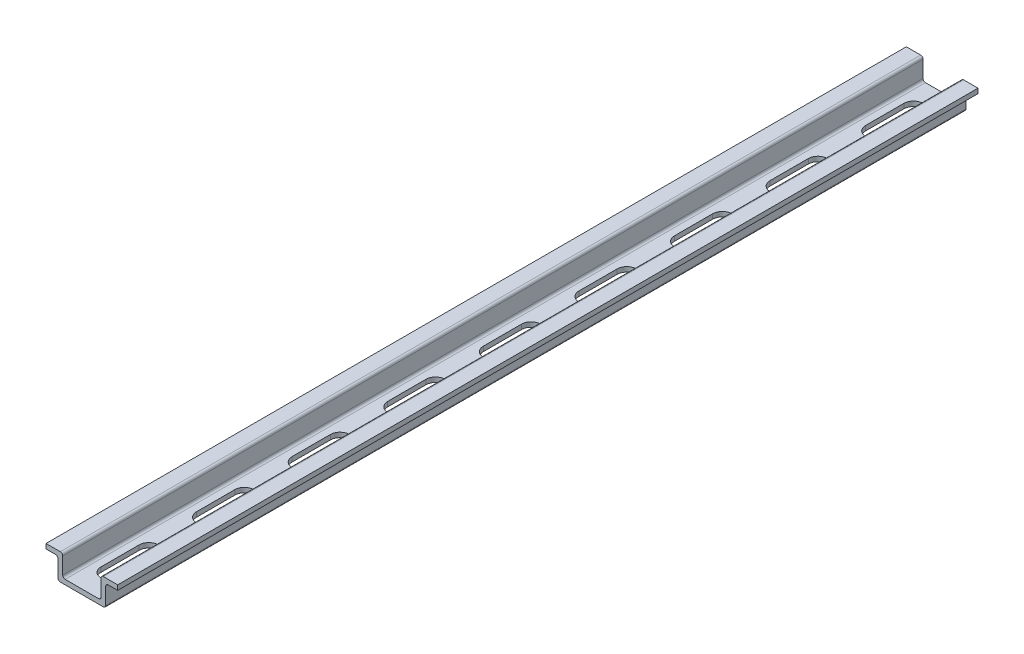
ISO-10303-21;
HEADER;
FILE_DESCRIPTION(('STEP AP214'),'2;1');
FILE_NAME('part.step','',(''),(''),'','','');
FILE_SCHEMA(('AUTOMOTIVE_DESIGN { 1 0 10303 214 1 1 1 1 }'));
ENDSEC;
DATA;
#1=APPLICATION_CONTEXT('core data for automotive mechanical design processes');
#2=APPLICATION_PROTOCOL_DEFINITION('international standard','automotive_design',2000,#1);
#3=PRODUCT_CONTEXT('',#1,'mechanical');
#4=PRODUCT('Part','Part','',(#3));
#5=PRODUCT_RELATED_PRODUCT_CATEGORY('part','',(#4));
#6=PRODUCT_DEFINITION_FORMATION('','',#4);
#7=PRODUCT_DEFINITION_CONTEXT('part definition',#1,'design');
#8=PRODUCT_DEFINITION('design','',#6,#7);
#9=PRODUCT_DEFINITION_SHAPE('','',#8);
#10=(LENGTH_UNIT() NAMED_UNIT(*) SI_UNIT(.MILLI.,.METRE.));
#11=(NAMED_UNIT(*) PLANE_ANGLE_UNIT() SI_UNIT($,.RADIAN.));
#12=(NAMED_UNIT(*) SI_UNIT($,.STERADIAN.) SOLID_ANGLE_UNIT());
#13=UNCERTAINTY_MEASURE_WITH_UNIT(LENGTH_MEASURE(1.E-05),#10,'distance_accuracy_value','');
#14=(GEOMETRIC_REPRESENTATION_CONTEXT(3) GLOBAL_UNCERTAINTY_ASSIGNED_CONTEXT((#13)) GLOBAL_UNIT_ASSIGNED_CONTEXT((#10,
#11,#12)) REPRESENTATION_CONTEXT('',''));
#15=CARTESIAN_POINT('',(0.,0.,0.));
#16=DIRECTION('',(0.,0.,1.));
#17=DIRECTION('',(1.,0.,0.));
#18=AXIS2_PLACEMENT_3D('',#15,#16,#17);
#19=CARTESIAN_POINT('',(-7.5,4.5,90.));
#20=DIRECTION('',(1.,0.,0.));
#21=DIRECTION('',(0.,0.,-1.));
#22=AXIS2_PLACEMENT_3D('',#19,#20,#21);
#23=PLANE('',#22);
#24=DIRECTION('',(0.,-1.,0.));
#25=VECTOR('',#24,1.);
#26=CARTESIAN_POINT('',(-7.5,4.5,-90.));
#27=LINE('',#26,#25);
#28=CARTESIAN_POINT('',(-7.5,5.5,-90.));
#29=VERTEX_POINT('',#28);
#30=CARTESIAN_POINT('',(-7.5,4.5,-90.));
#31=VERTEX_POINT('',#30);
#32=EDGE_CURVE('E655',#29,#31,#27,.T.);
#33=ORIENTED_EDGE('',*,*,#32,.T.);
#34=DIRECTION('',(0.,0.,-1.));
#35=VECTOR('',#34,1.);
#36=CARTESIAN_POINT('',(-7.5,4.5,90.));
#37=LINE('',#36,#35);
#38=CARTESIAN_POINT('',(-7.5,4.5,90.));
#39=VERTEX_POINT('',#38);
#40=EDGE_CURVE('E11',#39,#31,#37,.T.);
#41=ORIENTED_EDGE('',*,*,#40,.F.);
#42=DIRECTION('',(0.,-1.,0.));
#43=VECTOR('',#42,1.);
#44=CARTESIAN_POINT('',(-7.5,4.5,90.));
#45=LINE('',#44,#43);
#46=CARTESIAN_POINT('',(-7.5,5.5,90.));
#47=VERTEX_POINT('',#46);
#48=EDGE_CURVE('E662',#47,#39,#45,.T.);
#49=ORIENTED_EDGE('',*,*,#48,.F.);
#50=DIRECTION('',(0.,0.,-1.));
#51=VECTOR('',#50,1.);
#52=CARTESIAN_POINT('',(-7.5,5.5,90.));
#53=LINE('',#52,#51);
#54=EDGE_CURVE('E704',#47,#29,#53,.T.);
#55=ORIENTED_EDGE('',*,*,#54,.T.);
#56=EDGE_LOOP('',(#33,#41,#49,#55));
#57=FACE_BOUND('',#56,.T.);
#58=ADVANCED_FACE('F17',(#57),#23,.F.);
#59=CARTESIAN_POINT('',(-5.5,4.5,90.));
#60=DIRECTION('',(0.,1.,0.));
#61=DIRECTION('',(-1.,0.,0.));
#62=AXIS2_PLACEMENT_3D('',#59,#60,#61);
#63=PLANE('',#62);
#64=DIRECTION('',(1.,0.,0.));
#65=VECTOR('',#64,1.);
#66=CARTESIAN_POINT('',(-5.5,4.5,-90.));
#67=LINE('',#66,#65);
#68=CARTESIAN_POINT('',(-5.5,4.5,-90.));
#69=VERTEX_POINT('',#68);
#70=EDGE_CURVE('E707',#31,#69,#67,.T.);
#71=ORIENTED_EDGE('',*,*,#70,.T.);
#72=DIRECTION('',(0.,0.,-1.));
#73=VECTOR('',#72,1.);
#74=CARTESIAN_POINT('',(-5.5,4.5,90.));
#75=LINE('',#74,#73);
#76=CARTESIAN_POINT('',(-5.5,4.5,90.));
#77=VERTEX_POINT('',#76);
#78=EDGE_CURVE('E24',#77,#69,#75,.T.);
#79=ORIENTED_EDGE('',*,*,#78,.F.);
#80=DIRECTION('',(1.,0.,0.));
#81=VECTOR('',#80,1.);
#82=CARTESIAN_POINT('',(-5.5,4.5,90.));
#83=LINE('',#82,#81);
#84=EDGE_CURVE('E665',#39,#77,#83,.T.);
#85=ORIENTED_EDGE('',*,*,#84,.F.);
#86=ORIENTED_EDGE('',*,*,#40,.T.);
#87=EDGE_LOOP('',(#71,#79,#85,#86));
#88=FACE_BOUND('',#87,.T.);
#89=ADVANCED_FACE('F824',(#88),#63,.F.);
#90=CARTESIAN_POINT('',(-5.5,4.,90.));
#91=DIRECTION('',(0.,0.,-1.));
#92=DIRECTION('',(-1.,0.,0.));
#93=AXIS2_PLACEMENT_3D('',#90,#91,#92);
#94=CYLINDRICAL_SURFACE('',#93,0.5);
#95=CARTESIAN_POINT('',(-5.5,4.,-90.));
#96=DIRECTION('',(0.,0.,-1.));
#97=DIRECTION('',(1.,0.,0.));
#98=AXIS2_PLACEMENT_3D('',#95,#96,#97);
#99=CIRCLE('',#98,0.5);
#100=CARTESIAN_POINT('',(-5.,4.,-90.));
#101=VERTEX_POINT('',#100);
#102=EDGE_CURVE('E709',#69,#101,#99,.T.);
#103=ORIENTED_EDGE('',*,*,#102,.T.);
#104=DIRECTION('',(0.,0.,-1.));
#105=VECTOR('',#104,1.);
#106=CARTESIAN_POINT('',(-5.,4.,90.));
#107=LINE('',#106,#105);
#108=CARTESIAN_POINT('',(-5.,4.,90.));
#109=VERTEX_POINT('',#108);
#110=EDGE_CURVE('E794',#109,#101,#107,.T.);
#111=ORIENTED_EDGE('',*,*,#110,.F.);
#112=CARTESIAN_POINT('',(-5.5,4.,90.));
#113=DIRECTION('',(0.,0.,-1.));
#114=DIRECTION('',(1.,0.,0.));
#115=AXIS2_PLACEMENT_3D('',#112,#113,#114);
#116=CIRCLE('',#115,0.5);
#117=EDGE_CURVE('E668',#77,#109,#116,.T.);
#118=ORIENTED_EDGE('',*,*,#117,.F.);
#119=ORIENTED_EDGE('',*,*,#78,.T.);
#120=EDGE_LOOP('',(#103,#111,#118,#119));
#121=FACE_BOUND('',#120,.T.);
#122=ADVANCED_FACE('F801',(#121),#94,.F.);
#123=CARTESIAN_POINT('',(-5.,0.5,90.));
#124=DIRECTION('',(1.,0.,0.));
#125=DIRECTION('',(0.,0.,-1.));
#126=AXIS2_PLACEMENT_3D('',#123,#124,#125);
#127=PLANE('',#126);
#128=DIRECTION('',(0.,-1.,0.));
#129=VECTOR('',#128,1.);
#130=CARTESIAN_POINT('',(-5.,0.5,-90.));
#131=LINE('',#130,#129);
#132=CARTESIAN_POINT('',(-5.,0.5,-90.));
#133=VERTEX_POINT('',#132);
#134=EDGE_CURVE('E711',#101,#133,#131,.T.);
#135=ORIENTED_EDGE('',*,*,#134,.T.);
#136=DIRECTION('',(0.,0.,-1.));
#137=VECTOR('',#136,1.);
#138=CARTESIAN_POINT('',(-5.,0.5,90.));
#139=LINE('',#138,#137);
#140=CARTESIAN_POINT('',(-5.,0.5,90.));
#141=VERTEX_POINT('',#140);
#142=EDGE_CURVE('E791',#141,#133,#139,.T.);
#143=ORIENTED_EDGE('',*,*,#142,.F.);
#144=DIRECTION('',(0.,-1.,0.));
#145=VECTOR('',#144,1.);
#146=CARTESIAN_POINT('',(-5.,0.5,90.));
#147=LINE('',#146,#145);
#148=EDGE_CURVE('E670',#109,#141,#147,.T.);
#149=ORIENTED_EDGE('',*,*,#148,.F.);
#150=ORIENTED_EDGE('',*,*,#110,.T.);
#151=EDGE_LOOP('',(#135,#143,#149,#150));
#152=FACE_BOUND('',#151,.T.);
#153=ADVANCED_FACE('F812',(#152),#127,.F.);
#154=CARTESIAN_POINT('',(-4.5,0.5,90.));
#155=DIRECTION('',(0.,0.,-1.));
#156=DIRECTION('',(-1.,0.,0.));
#157=AXIS2_PLACEMENT_3D('',#154,#155,#156);
#158=CYLINDRICAL_SURFACE('',#157,0.5);
#159=CARTESIAN_POINT('',(-4.5,0.5,-90.));
#160=DIRECTION('',(0.,0.,1.));
#161=DIRECTION('',(-1.,0.,0.));
#162=AXIS2_PLACEMENT_3D('',#159,#160,#161);
#163=CIRCLE('',#162,0.5);
#164=CARTESIAN_POINT('',(-4.5,0.,-90.));
#165=VERTEX_POINT('',#164);
#166=EDGE_CURVE('E713',#133,#165,#163,.T.);
#167=ORIENTED_EDGE('',*,*,#166,.T.);
#168=DIRECTION('',(0.,0.,-1.));
#169=VECTOR('',#168,1.);
#170=CARTESIAN_POINT('',(-4.5,0.,90.));
#171=LINE('',#170,#169);
#172=CARTESIAN_POINT('',(-4.5,0.,90.));
#173=VERTEX_POINT('',#172);
#174=EDGE_CURVE('E788',#173,#165,#171,.T.);
#175=ORIENTED_EDGE('',*,*,#174,.F.);
#176=CARTESIAN_POINT('',(-4.5,0.5,90.));
#177=DIRECTION('',(0.,0.,1.));
#178=DIRECTION('',(-1.,0.,0.));
#179=AXIS2_PLACEMENT_3D('',#176,#177,#178);
#180=CIRCLE('',#179,0.5);
#181=EDGE_CURVE('E672',#141,#173,#180,.T.);
#182=ORIENTED_EDGE('',*,*,#181,.F.);
#183=ORIENTED_EDGE('',*,*,#142,.T.);
#184=EDGE_LOOP('',(#167,#175,#182,#183));
#185=FACE_BOUND('',#184,.T.);
#186=ADVANCED_FACE('F816',(#185),#158,.T.);
#187=CARTESIAN_POINT('',(4.5,0.,90.));
#188=DIRECTION('',(0.,1.,0.));
#189=DIRECTION('',(0.,0.,1.));
#190=AXIS2_PLACEMENT_3D('',#187,#188,#189);
#191=PLANE('',#190);
#192=DIRECTION('',(0.,0.,-1.));
#193=VECTOR('',#192,1.);
#194=CARTESIAN_POINT('',(2.00000000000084,0.,76.));
#195=LINE('',#194,#193);
#196=CARTESIAN_POINT('',(2.00000000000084,0.,84.));
#197=VERTEX_POINT('',#196);
#198=CARTESIAN_POINT('',(2.00000000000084,0.,76.));
#199=VERTEX_POINT('',#198);
#200=EDGE_CURVE('E377',#197,#199,#195,.T.);
#201=ORIENTED_EDGE('',*,*,#200,.T.);
#202=CARTESIAN_POINT('',(8.38280781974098E-13,0.,76.));
#203=DIRECTION('',(0.,1.,0.));
#204=DIRECTION('',(-1.,0.,0.));
#205=AXIS2_PLACEMENT_3D('',#202,#203,#204);
#206=CIRCLE('',#205,2.);
#207=CARTESIAN_POINT('',(-1.99999999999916,0.,76.));
#208=VERTEX_POINT('',#207);
#209=EDGE_CURVE('E371',#199,#208,#206,.T.);
#210=ORIENTED_EDGE('',*,*,#209,.T.);
#211=DIRECTION('',(0.,0.,1.));
#212=VECTOR('',#211,1.);
#213=CARTESIAN_POINT('',(-1.99999999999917,0.,84.));
#214=LINE('',#213,#212);
#215=CARTESIAN_POINT('',(-1.99999999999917,0.,84.));
#216=VERTEX_POINT('',#215);
#217=EDGE_CURVE('E380',#208,#216,#214,.T.);
#218=ORIENTED_EDGE('',*,*,#217,.T.);
#219=CARTESIAN_POINT('',(8.3882288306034E-13,0.,84.));
#220=DIRECTION('',(0.,1.,0.));
#221=DIRECTION('',(1.,0.,0.));
#222=AXIS2_PLACEMENT_3D('',#219,#220,#221);
#223=CIRCLE('',#222,2.);
#224=EDGE_CURVE('E31',#216,#197,#223,.T.);
#225=ORIENTED_EDGE('',*,*,#224,.T.);
#226=EDGE_LOOP('',(#201,#210,#218,#225));
#227=FACE_BOUND('',#226,.T.);
#228=DIRECTION('',(0.,0.,-1.));
#229=VECTOR('',#228,1.);
#230=CARTESIAN_POINT('',(2.00000000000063,0.,56.));
#231=LINE('',#230,#229);
#232=CARTESIAN_POINT('',(2.00000000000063,0.,64.));
#233=VERTEX_POINT('',#232);
#234=CARTESIAN_POINT('',(2.00000000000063,0.,56.));
#235=VERTEX_POINT('',#234);
#236=EDGE_CURVE('E416',#233,#235,#231,.T.);
#237=ORIENTED_EDGE('',*,*,#236,.T.);
#238=CARTESIAN_POINT('',(6.2879190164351E-13,0.,56.));
#239=DIRECTION('',(0.,1.,0.));
#240=DIRECTION('',(-1.,0.,0.));
#241=AXIS2_PLACEMENT_3D('',#238,#239,#240);
#242=CIRCLE('',#241,2.);
#243=CARTESIAN_POINT('',(-1.99999999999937,0.,56.));
#244=VERTEX_POINT('',#243);
#245=EDGE_CURVE('E406',#235,#244,#242,.T.);
#246=ORIENTED_EDGE('',*,*,#245,.T.);
#247=DIRECTION('',(0.,0.,1.));
#248=VECTOR('',#247,1.);
#249=CARTESIAN_POINT('',(-1.99999999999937,0.,64.));
#250=LINE('',#249,#248);
#251=CARTESIAN_POINT('',(-1.99999999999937,0.,64.));
#252=VERTEX_POINT('',#251);
#253=EDGE_CURVE('E409',#244,#252,#250,.T.);
#254=ORIENTED_EDGE('',*,*,#253,.T.);
#255=CARTESIAN_POINT('',(6.29334002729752E-13,0.,64.));
#256=DIRECTION('',(0.,1.,0.));
#257=DIRECTION('',(1.,0.,0.));
#258=AXIS2_PLACEMENT_3D('',#255,#256,#257);
#259=CIRCLE('',#258,2.);
#260=EDGE_CURVE('E413',#252,#233,#259,.T.);
#261=ORIENTED_EDGE('',*,*,#260,.T.);
#262=EDGE_LOOP('',(#237,#246,#254,#261));
#263=FACE_BOUND('',#262,.T.);
#264=DIRECTION('',(0.,0.,-1.));
#265=VECTOR('',#264,1.);
#266=CARTESIAN_POINT('',(2.00000000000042,0.,36.));
#267=LINE('',#266,#265);
#268=CARTESIAN_POINT('',(2.00000000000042,0.,44.));
#269=VERTEX_POINT('',#268);
#270=CARTESIAN_POINT('',(2.00000000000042,0.,36.));
#271=VERTEX_POINT('',#270);
#272=EDGE_CURVE('E448',#269,#271,#267,.T.);
#273=ORIENTED_EDGE('',*,*,#272,.T.);
#274=CARTESIAN_POINT('',(4.19303021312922E-13,0.,36.));
#275=DIRECTION('',(0.,1.,0.));
#276=DIRECTION('',(-1.,0.,0.));
#277=AXIS2_PLACEMENT_3D('',#274,#275,#276);
#278=CIRCLE('',#277,2.);
#279=CARTESIAN_POINT('',(-1.99999999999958,0.,36.));
#280=VERTEX_POINT('',#279);
#281=EDGE_CURVE('E438',#271,#280,#278,.T.);
#282=ORIENTED_EDGE('',*,*,#281,.T.);
#283=DIRECTION('',(0.,0.,1.));
#284=VECTOR('',#283,1.);
#285=CARTESIAN_POINT('',(-1.99999999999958,0.,44.));
#286=LINE('',#285,#284);
#287=CARTESIAN_POINT('',(-1.99999999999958,0.,44.));
#288=VERTEX_POINT('',#287);
#289=EDGE_CURVE('E441',#280,#288,#286,.T.);
#290=ORIENTED_EDGE('',*,*,#289,.T.);
#291=CARTESIAN_POINT('',(4.19845122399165E-13,0.,44.));
#292=DIRECTION('',(0.,1.,0.));
#293=DIRECTION('',(1.,0.,0.));
#294=AXIS2_PLACEMENT_3D('',#291,#292,#293);
#295=CIRCLE('',#294,2.);
#296=EDGE_CURVE('E445',#288,#269,#295,.T.);
#297=ORIENTED_EDGE('',*,*,#296,.T.);
#298=EDGE_LOOP('',(#273,#282,#290,#297));
#299=FACE_BOUND('',#298,.T.);
#300=DIRECTION('',(0.,0.,-1.));
#301=VECTOR('',#300,1.);
#302=CARTESIAN_POINT('',(2.00000000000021,0.,16.));
#303=LINE('',#302,#301);
#304=CARTESIAN_POINT('',(2.00000000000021,0.,24.));
#305=VERTEX_POINT('',#304);
#306=CARTESIAN_POINT('',(2.00000000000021,0.,16.));
#307=VERTEX_POINT('',#306);
#308=EDGE_CURVE('E480',#305,#307,#303,.T.);
#309=ORIENTED_EDGE('',*,*,#308,.T.);
#310=CARTESIAN_POINT('',(2.09814140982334E-13,0.,16.));
#311=DIRECTION('',(0.,1.,0.));
#312=DIRECTION('',(-1.,0.,0.));
#313=AXIS2_PLACEMENT_3D('',#310,#311,#312);
#314=CIRCLE('',#313,2.);
#315=CARTESIAN_POINT('',(-1.99999999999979,0.,16.));
#316=VERTEX_POINT('',#315);
#317=EDGE_CURVE('E470',#307,#316,#314,.T.);
#318=ORIENTED_EDGE('',*,*,#317,.T.);
#319=DIRECTION('',(0.,0.,1.));
#320=VECTOR('',#319,1.);
#321=CARTESIAN_POINT('',(-1.99999999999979,0.,24.));
#322=LINE('',#321,#320);
#323=CARTESIAN_POINT('',(-1.99999999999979,0.,24.));
#324=VERTEX_POINT('',#323);
#325=EDGE_CURVE('E473',#316,#324,#322,.T.);
#326=ORIENTED_EDGE('',*,*,#325,.T.);
#327=CARTESIAN_POINT('',(2.10356242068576E-13,0.,24.));
#328=DIRECTION('',(0.,1.,0.));
#329=DIRECTION('',(1.,0.,0.));
#330=AXIS2_PLACEMENT_3D('',#327,#328,#329);
#331=CIRCLE('',#330,2.);
#332=EDGE_CURVE('E477',#324,#305,#331,.T.);
#333=ORIENTED_EDGE('',*,*,#332,.T.);
#334=EDGE_LOOP('',(#309,#318,#326,#333));
#335=FACE_BOUND('',#334,.T.);
#336=DIRECTION('',(0.,0.,-1.));
#337=VECTOR('',#336,1.);
#338=CARTESIAN_POINT('',(1.99999999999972,0.,-84.));
#339=LINE('',#338,#337);
#340=CARTESIAN_POINT('',(1.99999999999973,0.,-76.));
#341=VERTEX_POINT('',#340);
#342=CARTESIAN_POINT('',(1.99999999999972,0.,-84.));
#343=VERTEX_POINT('',#342);
#344=EDGE_CURVE('E512',#341,#343,#339,.T.);
#345=ORIENTED_EDGE('',*,*,#344,.T.);
#346=CARTESIAN_POINT('',(-2.78993246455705E-13,0.,-84.));
#347=DIRECTION('',(0.,1.,0.));
#348=DIRECTION('',(-1.,0.,0.));
#349=AXIS2_PLACEMENT_3D('',#346,#347,#348);
#350=CIRCLE('',#349,2.);
#351=CARTESIAN_POINT('',(-2.00000000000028,0.,-84.));
#352=VERTEX_POINT('',#351);
#353=EDGE_CURVE('E502',#343,#352,#350,.T.);
#354=ORIENTED_EDGE('',*,*,#353,.T.);
#355=DIRECTION('',(0.,0.,1.));
#356=VECTOR('',#355,1.);
#357=CARTESIAN_POINT('',(-2.00000000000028,0.,-76.));
#358=LINE('',#357,#356);
#359=CARTESIAN_POINT('',(-2.00000000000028,0.,-76.));
#360=VERTEX_POINT('',#359);
#361=EDGE_CURVE('E505',#352,#360,#358,.T.);
#362=ORIENTED_EDGE('',*,*,#361,.T.);
#363=CARTESIAN_POINT('',(-2.78451145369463E-13,0.,-76.));
#364=DIRECTION('',(0.,1.,0.));
#365=DIRECTION('',(1.,0.,0.));
#366=AXIS2_PLACEMENT_3D('',#363,#364,#365);
#367=CIRCLE('',#366,2.);
#368=EDGE_CURVE('E509',#360,#341,#367,.T.);
#369=ORIENTED_EDGE('',*,*,#368,.T.);
#370=EDGE_LOOP('',(#345,#354,#362,#369));
#371=FACE_BOUND('',#370,.T.);
#372=DIRECTION('',(0.,0.,-1.));
#373=VECTOR('',#372,1.);
#374=CARTESIAN_POINT('',(1.99999999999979,0.,-64.));
#375=LINE('',#374,#373);
#376=CARTESIAN_POINT('',(1.99999999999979,0.,-56.));
#377=VERTEX_POINT('',#376);
#378=CARTESIAN_POINT('',(1.99999999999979,0.,-64.));
#379=VERTEX_POINT('',#378);
#380=EDGE_CURVE('E544',#377,#379,#375,.T.);
#381=ORIENTED_EDGE('',*,*,#380,.T.);
#382=CARTESIAN_POINT('',(-2.09163619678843E-13,0.,-64.));
#383=DIRECTION('',(0.,1.,0.));
#384=DIRECTION('',(-1.,0.,0.));
#385=AXIS2_PLACEMENT_3D('',#382,#383,#384);
#386=CIRCLE('',#385,2.);
#387=CARTESIAN_POINT('',(-2.00000000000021,0.,-64.));
#388=VERTEX_POINT('',#387);
#389=EDGE_CURVE('E534',#379,#388,#386,.T.);
#390=ORIENTED_EDGE('',*,*,#389,.T.);
#391=DIRECTION('',(0.,0.,1.));
#392=VECTOR('',#391,1.);
#393=CARTESIAN_POINT('',(-2.00000000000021,0.,-56.));
#394=LINE('',#393,#392);
#395=CARTESIAN_POINT('',(-2.00000000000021,0.,-56.));
#396=VERTEX_POINT('',#395);
#397=EDGE_CURVE('E537',#388,#396,#394,.T.);
#398=ORIENTED_EDGE('',*,*,#397,.T.);
#399=CARTESIAN_POINT('',(-2.08621518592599E-13,0.,-56.));
#400=DIRECTION('',(0.,1.,0.));
#401=DIRECTION('',(1.,0.,0.));
#402=AXIS2_PLACEMENT_3D('',#399,#400,#401);
#403=CIRCLE('',#402,2.);
#404=EDGE_CURVE('E541',#396,#377,#403,.T.);
#405=ORIENTED_EDGE('',*,*,#404,.T.);
#406=EDGE_LOOP('',(#381,#390,#398,#405));
#407=FACE_BOUND('',#406,.T.);
#408=DIRECTION('',(0.,0.,-1.));
#409=VECTOR('',#408,1.);
#410=CARTESIAN_POINT('',(1.99999999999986,0.,-44.));
#411=LINE('',#410,#409);
#412=CARTESIAN_POINT('',(1.99999999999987,0.,-36.));
#413=VERTEX_POINT('',#412);
#414=CARTESIAN_POINT('',(1.99999999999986,0.,-44.));
#415=VERTEX_POINT('',#414);
#416=EDGE_CURVE('E576',#413,#415,#411,.T.);
#417=ORIENTED_EDGE('',*,*,#416,.T.);
#418=CARTESIAN_POINT('',(-1.3933399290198E-13,0.,-44.));
#419=DIRECTION('',(0.,1.,0.));
#420=DIRECTION('',(-1.,0.,0.));
#421=AXIS2_PLACEMENT_3D('',#418,#419,#420);
#422=CIRCLE('',#421,2.);
#423=CARTESIAN_POINT('',(-2.00000000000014,0.,-44.));
#424=VERTEX_POINT('',#423);
#425=EDGE_CURVE('E566',#415,#424,#422,.T.);
#426=ORIENTED_EDGE('',*,*,#425,.T.);
#427=DIRECTION('',(0.,0.,1.));
#428=VECTOR('',#427,1.);
#429=CARTESIAN_POINT('',(-2.00000000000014,0.,-36.));
#430=LINE('',#429,#428);
#431=CARTESIAN_POINT('',(-2.00000000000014,0.,-36.));
#432=VERTEX_POINT('',#431);
#433=EDGE_CURVE('E569',#424,#432,#430,.T.);
#434=ORIENTED_EDGE('',*,*,#433,.T.);
#435=CARTESIAN_POINT('',(-1.38791891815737E-13,0.,-36.));
#436=DIRECTION('',(0.,1.,0.));
#437=DIRECTION('',(1.,0.,0.));
#438=AXIS2_PLACEMENT_3D('',#435,#436,#437);
#439=CIRCLE('',#438,2.);
#440=EDGE_CURVE('E573',#432,#413,#439,.T.);
#441=ORIENTED_EDGE('',*,*,#440,.T.);
#442=EDGE_LOOP('',(#417,#426,#434,#441));
#443=FACE_BOUND('',#442,.T.);
#444=DIRECTION('',(0.,0.,-1.));
#445=VECTOR('',#444,1.);
#446=CARTESIAN_POINT('',(1.99999999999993,0.,-24.));
#447=LINE('',#446,#445);
#448=CARTESIAN_POINT('',(1.99999999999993,0.,-16.));
#449=VERTEX_POINT('',#448);
#450=CARTESIAN_POINT('',(1.99999999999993,0.,-24.));
#451=VERTEX_POINT('',#450);
#452=EDGE_CURVE('E608',#449,#451,#447,.T.);
#453=ORIENTED_EDGE('',*,*,#452,.T.);
#454=CARTESIAN_POINT('',(0.,0.,-24.));
#455=DIRECTION('',(0.,1.,0.));
#456=DIRECTION('',(-1.,0.,0.));
#457=AXIS2_PLACEMENT_3D('',#454,#455,#456);
#458=CIRCLE('',#457,2.);
#459=CARTESIAN_POINT('',(-2.00000000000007,0.,-24.));
#460=VERTEX_POINT('',#459);
#461=EDGE_CURVE('E598',#451,#460,#458,.T.);
#462=ORIENTED_EDGE('',*,*,#461,.T.);
#463=DIRECTION('',(0.,0.,1.));
#464=VECTOR('',#463,1.);
#465=CARTESIAN_POINT('',(-2.00000000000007,0.,-16.));
#466=LINE('',#465,#464);
#467=CARTESIAN_POINT('',(-2.00000000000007,0.,-16.));
#468=VERTEX_POINT('',#467);
#469=EDGE_CURVE('E601',#460,#468,#466,.T.);
#470=ORIENTED_EDGE('',*,*,#469,.T.);
#471=CARTESIAN_POINT('',(0.,0.,-16.));
#472=DIRECTION('',(0.,1.,0.));
#473=DIRECTION('',(1.,0.,0.));
#474=AXIS2_PLACEMENT_3D('',#471,#472,#473);
#475=CIRCLE('',#474,2.);
#476=EDGE_CURVE('E605',#468,#449,#475,.T.);
#477=ORIENTED_EDGE('',*,*,#476,.T.);
#478=EDGE_LOOP('',(#453,#462,#470,#477));
#479=FACE_BOUND('',#478,.T.);
#480=DIRECTION('',(0.,0.,-1.));
#481=VECTOR('',#480,1.);
#482=CARTESIAN_POINT('',(2.,0.,-4.));
#483=LINE('',#482,#481);
#484=CARTESIAN_POINT('',(2.,0.,4.));
#485=VERTEX_POINT('',#484);
#486=CARTESIAN_POINT('',(2.,0.,-4.));
#487=VERTEX_POINT('',#486);
#488=EDGE_CURVE('E640',#485,#487,#483,.T.);
#489=ORIENTED_EDGE('',*,*,#488,.T.);
#490=CARTESIAN_POINT('',(0.,0.,-4.));
#491=DIRECTION('',(0.,1.,0.));
#492=DIRECTION('',(-1.,0.,0.));
#493=AXIS2_PLACEMENT_3D('',#490,#491,#492);
#494=CIRCLE('',#493,2.);
#495=CARTESIAN_POINT('',(-2.,0.,-4.));
#496=VERTEX_POINT('',#495);
#497=EDGE_CURVE('E630',#487,#496,#494,.T.);
#498=ORIENTED_EDGE('',*,*,#497,.T.);
#499=DIRECTION('',(0.,0.,1.));
#500=VECTOR('',#499,1.);
#501=CARTESIAN_POINT('',(-2.,0.,4.));
#502=LINE('',#501,#500);
#503=CARTESIAN_POINT('',(-2.,0.,4.));
#504=VERTEX_POINT('',#503);
#505=EDGE_CURVE('E633',#496,#504,#502,.T.);
#506=ORIENTED_EDGE('',*,*,#505,.T.);
#507=CARTESIAN_POINT('',(0.,0.,4.));
#508=DIRECTION('',(0.,1.,0.));
#509=DIRECTION('',(1.,0.,0.));
#510=AXIS2_PLACEMENT_3D('',#507,#508,#509);
#511=CIRCLE('',#510,2.);
#512=EDGE_CURVE('E637',#504,#485,#511,.T.);
#513=ORIENTED_EDGE('',*,*,#512,.T.);
#514=EDGE_LOOP('',(#489,#498,#506,#513));
#515=FACE_BOUND('',#514,.T.);
#516=DIRECTION('',(1.,0.,0.));
#517=VECTOR('',#516,1.);
#518=CARTESIAN_POINT('',(4.5,0.,-90.));
#519=LINE('',#518,#517);
#520=CARTESIAN_POINT('',(4.5,0.,-90.));
#521=VERTEX_POINT('',#520);
#522=EDGE_CURVE('E715',#165,#521,#519,.T.);
#523=ORIENTED_EDGE('',*,*,#522,.T.);
#524=DIRECTION('',(0.,0.,-1.));
#525=VECTOR('',#524,1.);
#526=CARTESIAN_POINT('',(4.5,0.,90.));
#527=LINE('',#526,#525);
#528=CARTESIAN_POINT('',(4.5,0.,90.));
#529=VERTEX_POINT('',#528);
#530=EDGE_CURVE('E785',#529,#521,#527,.T.);
#531=ORIENTED_EDGE('',*,*,#530,.F.);
#532=DIRECTION('',(1.,0.,0.));
#533=VECTOR('',#532,1.);
#534=CARTESIAN_POINT('',(4.5,0.,90.));
#535=LINE('',#534,#533);
#536=EDGE_CURVE('E674',#173,#529,#535,.T.);
#537=ORIENTED_EDGE('',*,*,#536,.F.);
#538=ORIENTED_EDGE('',*,*,#174,.T.);
#539=EDGE_LOOP('',(#523,#531,#537,#538));
#540=FACE_BOUND('',#539,.T.);
#541=ADVANCED_FACE('F384',(#227,#263,#299,#335,#371,#407,#443,#479,#515,#540),#191,.F.);
#542=CARTESIAN_POINT('',(4.5,0.5,90.));
#543=DIRECTION('',(0.,0.,-1.));
#544=DIRECTION('',(-1.,0.,0.));
#545=AXIS2_PLACEMENT_3D('',#542,#543,#544);
#546=CYLINDRICAL_SURFACE('',#545,0.5);
#547=CARTESIAN_POINT('',(4.5,0.5,-90.));
#548=DIRECTION('',(0.,0.,1.));
#549=DIRECTION('',(-1.,0.,0.));
#550=AXIS2_PLACEMENT_3D('',#547,#548,#549);
#551=CIRCLE('',#550,0.5);
#552=CARTESIAN_POINT('',(5.,0.5,-90.));
#553=VERTEX_POINT('',#552);
#554=EDGE_CURVE('E717',#521,#553,#551,.T.);
#555=ORIENTED_EDGE('',*,*,#554,.T.);
#556=DIRECTION('',(0.,0.,-1.));
#557=VECTOR('',#556,1.);
#558=CARTESIAN_POINT('',(5.,0.5,90.));
#559=LINE('',#558,#557);
#560=CARTESIAN_POINT('',(5.,0.5,90.));
#561=VERTEX_POINT('',#560);
#562=EDGE_CURVE('E782',#561,#553,#559,.T.);
#563=ORIENTED_EDGE('',*,*,#562,.F.);
#564=CARTESIAN_POINT('',(4.5,0.5,90.));
#565=DIRECTION('',(0.,0.,1.));
#566=DIRECTION('',(-1.,0.,0.));
#567=AXIS2_PLACEMENT_3D('',#564,#565,#566);
#568=CIRCLE('',#567,0.5);
#569=EDGE_CURVE('E676',#529,#561,#568,.T.);
#570=ORIENTED_EDGE('',*,*,#569,.F.);
#571=ORIENTED_EDGE('',*,*,#530,.T.);
#572=EDGE_LOOP('',(#555,#563,#570,#571));
#573=FACE_BOUND('',#572,.T.);
#574=ADVANCED_FACE('F895',(#573),#546,.T.);
#575=CARTESIAN_POINT('',(5.,4.,90.));
#576=DIRECTION('',(-1.,0.,0.));
#577=DIRECTION('',(0.,0.,1.));
#578=AXIS2_PLACEMENT_3D('',#575,#576,#577);
#579=PLANE('',#578);
#580=DIRECTION('',(0.,1.,0.));
#581=VECTOR('',#580,1.);
#582=CARTESIAN_POINT('',(5.,4.,-90.));
#583=LINE('',#582,#581);
#584=CARTESIAN_POINT('',(5.,4.,-90.));
#585=VERTEX_POINT('',#584);
#586=EDGE_CURVE('E719',#553,#585,#583,.T.);
#587=ORIENTED_EDGE('',*,*,#586,.T.);
#588=DIRECTION('',(0.,0.,-1.));
#589=VECTOR('',#588,1.);
#590=CARTESIAN_POINT('',(5.,4.,90.));
#591=LINE('',#590,#589);
#592=CARTESIAN_POINT('',(5.,4.,90.));
#593=VERTEX_POINT('',#592);
#594=EDGE_CURVE('E779',#593,#585,#591,.T.);
#595=ORIENTED_EDGE('',*,*,#594,.F.);
#596=DIRECTION('',(0.,1.,0.));
#597=VECTOR('',#596,1.);
#598=CARTESIAN_POINT('',(5.,4.,90.));
#599=LINE('',#598,#597);
#600=EDGE_CURVE('E678',#561,#593,#599,.T.);
#601=ORIENTED_EDGE('',*,*,#600,.F.);
#602=ORIENTED_EDGE('',*,*,#562,.T.);
#603=EDGE_LOOP('',(#587,#595,#601,#602));
#604=FACE_BOUND('',#603,.T.);
#605=ADVANCED_FACE('F890',(#604),#579,.F.);
#606=CARTESIAN_POINT('',(5.5,4.,90.));
#607=DIRECTION('',(0.,0.,-1.));
#608=DIRECTION('',(-1.,0.,0.));
#609=AXIS2_PLACEMENT_3D('',#606,#607,#608);
#610=CYLINDRICAL_SURFACE('',#609,0.5);
#611=CARTESIAN_POINT('',(5.5,4.,-90.));
#612=DIRECTION('',(0.,0.,-1.));
#613=DIRECTION('',(1.,0.,0.));
#614=AXIS2_PLACEMENT_3D('',#611,#612,#613);
#615=CIRCLE('',#614,0.5);
#616=CARTESIAN_POINT('',(5.5,4.5,-90.));
#617=VERTEX_POINT('',#616);
#618=EDGE_CURVE('E721',#585,#617,#615,.T.);
#619=ORIENTED_EDGE('',*,*,#618,.T.);
#620=DIRECTION('',(0.,0.,-1.));
#621=VECTOR('',#620,1.);
#622=CARTESIAN_POINT('',(5.5,4.5,90.));
#623=LINE('',#622,#621);
#624=CARTESIAN_POINT('',(5.5,4.5,90.));
#625=VERTEX_POINT('',#624);
#626=EDGE_CURVE('E776',#625,#617,#623,.T.);
#627=ORIENTED_EDGE('',*,*,#626,.F.);
#628=CARTESIAN_POINT('',(5.5,4.,90.));
#629=DIRECTION('',(0.,0.,-1.));
#630=DIRECTION('',(1.,0.,0.));
#631=AXIS2_PLACEMENT_3D('',#628,#629,#630);
#632=CIRCLE('',#631,0.5);
#633=EDGE_CURVE('E680',#593,#625,#632,.T.);
#634=ORIENTED_EDGE('',*,*,#633,.F.);
#635=ORIENTED_EDGE('',*,*,#594,.T.);
#636=EDGE_LOOP('',(#619,#627,#634,#635));
#637=FACE_BOUND('',#636,.T.);
#638=ADVANCED_FACE('F885',(#637),#610,.F.);
#639=CARTESIAN_POINT('',(7.5,4.5,90.));
#640=DIRECTION('',(0.,1.,0.));
#641=DIRECTION('',(-1.,0.,0.));
#642=AXIS2_PLACEMENT_3D('',#639,#640,#641);
#643=PLANE('',#642);
#644=DIRECTION('',(1.,0.,0.));
#645=VECTOR('',#644,1.);
#646=CARTESIAN_POINT('',(7.5,4.5,-90.));
#647=LINE('',#646,#645);
#648=CARTESIAN_POINT('',(7.5,4.5,-90.));
#649=VERTEX_POINT('',#648);
#650=EDGE_CURVE('E723',#617,#649,#647,.T.);
#651=ORIENTED_EDGE('',*,*,#650,.T.);
#652=DIRECTION('',(0.,0.,-1.));
#653=VECTOR('',#652,1.);
#654=CARTESIAN_POINT('',(7.5,4.5,90.));
#655=LINE('',#654,#653);
#656=CARTESIAN_POINT('',(7.5,4.5,90.));
#657=VERTEX_POINT('',#656);
#658=EDGE_CURVE('E773',#657,#649,#655,.T.);
#659=ORIENTED_EDGE('',*,*,#658,.F.);
#660=DIRECTION('',(1.,0.,0.));
#661=VECTOR('',#660,1.);
#662=CARTESIAN_POINT('',(7.5,4.5,90.));
#663=LINE('',#662,#661);
#664=EDGE_CURVE('E682',#625,#657,#663,.T.);
#665=ORIENTED_EDGE('',*,*,#664,.F.);
#666=ORIENTED_EDGE('',*,*,#626,.T.);
#667=EDGE_LOOP('',(#651,#659,#665,#666));
#668=FACE_BOUND('',#667,.T.);
#669=ADVANCED_FACE('F881',(#668),#643,.F.);
#670=CARTESIAN_POINT('',(7.5,5.5,90.));
#671=DIRECTION('',(-1.,0.,0.));
#672=DIRECTION('',(0.,-1.,0.));
#673=AXIS2_PLACEMENT_3D('',#670,#671,#672);
#674=PLANE('',#673);
#675=DIRECTION('',(0.,1.,0.));
#676=VECTOR('',#675,1.);
#677=CARTESIAN_POINT('',(7.5,5.5,-90.));
#678=LINE('',#677,#676);
#679=CARTESIAN_POINT('',(7.5,5.5,-90.));
#680=VERTEX_POINT('',#679);
#681=EDGE_CURVE('E725',#649,#680,#678,.T.);
#682=ORIENTED_EDGE('',*,*,#681,.T.);
#683=DIRECTION('',(0.,0.,-1.));
#684=VECTOR('',#683,1.);
#685=CARTESIAN_POINT('',(7.5,5.5,90.));
#686=LINE('',#685,#684);
#687=CARTESIAN_POINT('',(7.5,5.5,90.));
#688=VERTEX_POINT('',#687);
#689=EDGE_CURVE('E770',#688,#680,#686,.T.);
#690=ORIENTED_EDGE('',*,*,#689,.F.);
#691=DIRECTION('',(0.,1.,0.));
#692=VECTOR('',#691,1.);
#693=CARTESIAN_POINT('',(7.5,5.5,90.));
#694=LINE('',#693,#692);
#695=EDGE_CURVE('E684',#657,#688,#694,.T.);
#696=ORIENTED_EDGE('',*,*,#695,.F.);
#697=ORIENTED_EDGE('',*,*,#658,.T.);
#698=EDGE_LOOP('',(#682,#690,#696,#697));
#699=FACE_BOUND('',#698,.T.);
#700=ADVANCED_FACE('F876',(#699),#674,.F.);
#701=CARTESIAN_POINT('',(4.5,5.5,90.));
#702=DIRECTION('',(0.,-1.,0.));
#703=DIRECTION('',(1.,0.,0.));
#704=AXIS2_PLACEMENT_3D('',#701,#702,#703);
#705=PLANE('',#704);
#706=DIRECTION('',(-1.,0.,0.));
#707=VECTOR('',#706,1.);
#708=CARTESIAN_POINT('',(4.5,5.5,-90.));
#709=LINE('',#708,#707);
#710=CARTESIAN_POINT('',(4.5,5.5,-90.));
#711=VERTEX_POINT('',#710);
#712=EDGE_CURVE('E727',#680,#711,#709,.T.);
#713=ORIENTED_EDGE('',*,*,#712,.T.);
#714=DIRECTION('',(0.,0.,-1.));
#715=VECTOR('',#714,1.);
#716=CARTESIAN_POINT('',(4.5,5.5,90.));
#717=LINE('',#716,#715);
#718=CARTESIAN_POINT('',(4.5,5.5,90.));
#719=VERTEX_POINT('',#718);
#720=EDGE_CURVE('E767',#719,#711,#717,.T.);
#721=ORIENTED_EDGE('',*,*,#720,.F.);
#722=DIRECTION('',(-1.,0.,0.));
#723=VECTOR('',#722,1.);
#724=CARTESIAN_POINT('',(4.5,5.5,90.));
#725=LINE('',#724,#723);
#726=EDGE_CURVE('E686',#688,#719,#725,.T.);
#727=ORIENTED_EDGE('',*,*,#726,.F.);
#728=ORIENTED_EDGE('',*,*,#689,.T.);
#729=EDGE_LOOP('',(#713,#721,#727,#728));
#730=FACE_BOUND('',#729,.T.);
#731=ADVANCED_FACE('F870',(#730),#705,.F.);
#732=CARTESIAN_POINT('',(4.5,5.,90.));
#733=DIRECTION('',(0.,0.,-1.));
#734=DIRECTION('',(-1.,0.,0.));
#735=AXIS2_PLACEMENT_3D('',#732,#733,#734);
#736=CYLINDRICAL_SURFACE('',#735,0.5);
#737=CARTESIAN_POINT('',(4.5,5.,-90.));
#738=DIRECTION('',(0.,0.,1.));
#739=DIRECTION('',(1.,0.,0.));
#740=AXIS2_PLACEMENT_3D('',#737,#738,#739);
#741=CIRCLE('',#740,0.5);
#742=CARTESIAN_POINT('',(4.,5.,-90.));
#743=VERTEX_POINT('',#742);
#744=EDGE_CURVE('E729',#711,#743,#741,.T.);
#745=ORIENTED_EDGE('',*,*,#744,.T.);
#746=DIRECTION('',(0.,0.,-1.));
#747=VECTOR('',#746,1.);
#748=CARTESIAN_POINT('',(4.,5.,90.));
#749=LINE('',#748,#747);
#750=CARTESIAN_POINT('',(4.,5.,90.));
#751=VERTEX_POINT('',#750);
#752=EDGE_CURVE('E764',#751,#743,#749,.T.);
#753=ORIENTED_EDGE('',*,*,#752,.F.);
#754=CARTESIAN_POINT('',(4.5,5.,90.));
#755=DIRECTION('',(0.,0.,1.));
#756=DIRECTION('',(1.,0.,0.));
#757=AXIS2_PLACEMENT_3D('',#754,#755,#756);
#758=CIRCLE('',#757,0.5);
#759=EDGE_CURVE('E688',#719,#751,#758,.T.);
#760=ORIENTED_EDGE('',*,*,#759,.F.);
#761=ORIENTED_EDGE('',*,*,#720,.T.);
#762=EDGE_LOOP('',(#745,#753,#760,#761));
#763=FACE_BOUND('',#762,.T.);
#764=ADVANCED_FACE('F866',(#763),#736,.T.);
#765=CARTESIAN_POINT('',(4.,1.5,90.));
#766=DIRECTION('',(1.,0.,0.));
#767=DIRECTION('',(0.,0.,-1.));
#768=AXIS2_PLACEMENT_3D('',#765,#766,#767);
#769=PLANE('',#768);
#770=DIRECTION('',(0.,-1.,0.));
#771=VECTOR('',#770,1.);
#772=CARTESIAN_POINT('',(4.,1.5,-90.));
#773=LINE('',#772,#771);
#774=CARTESIAN_POINT('',(4.,1.5,-90.));
#775=VERTEX_POINT('',#774);
#776=EDGE_CURVE('E731',#743,#775,#773,.T.);
#777=ORIENTED_EDGE('',*,*,#776,.T.);
#778=DIRECTION('',(0.,0.,-1.));
#779=VECTOR('',#778,1.);
#780=CARTESIAN_POINT('',(4.,1.5,90.));
#781=LINE('',#780,#779);
#782=CARTESIAN_POINT('',(4.,1.5,90.));
#783=VERTEX_POINT('',#782);
#784=EDGE_CURVE('E761',#783,#775,#781,.T.);
#785=ORIENTED_EDGE('',*,*,#784,.F.);
#786=DIRECTION('',(0.,-1.,0.));
#787=VECTOR('',#786,1.);
#788=CARTESIAN_POINT('',(4.,1.5,90.));
#789=LINE('',#788,#787);
#790=EDGE_CURVE('E690',#751,#783,#789,.T.);
#791=ORIENTED_EDGE('',*,*,#790,.F.);
#792=ORIENTED_EDGE('',*,*,#752,.T.);
#793=EDGE_LOOP('',(#777,#785,#791,#792));
#794=FACE_BOUND('',#793,.T.);
#795=ADVANCED_FACE('F861',(#794),#769,.F.);
#796=CARTESIAN_POINT('',(3.5,1.5,90.));
#797=DIRECTION('',(0.,0.,-1.));
#798=DIRECTION('',(-1.,0.,0.));
#799=AXIS2_PLACEMENT_3D('',#796,#797,#798);
#800=CYLINDRICAL_SURFACE('',#799,0.5);
#801=CARTESIAN_POINT('',(3.5,1.5,-90.));
#802=DIRECTION('',(0.,0.,-1.));
#803=DIRECTION('',(-1.,0.,0.));
#804=AXIS2_PLACEMENT_3D('',#801,#802,#803);
#805=CIRCLE('',#804,0.5);
#806=CARTESIAN_POINT('',(3.5,1.,-90.));
#807=VERTEX_POINT('',#806);
#808=EDGE_CURVE('E733',#775,#807,#805,.T.);
#809=ORIENTED_EDGE('',*,*,#808,.T.);
#810=DIRECTION('',(0.,0.,-1.));
#811=VECTOR('',#810,1.);
#812=CARTESIAN_POINT('',(3.5,1.,90.));
#813=LINE('',#812,#811);
#814=CARTESIAN_POINT('',(3.5,1.,90.));
#815=VERTEX_POINT('',#814);
#816=EDGE_CURVE('E758',#815,#807,#813,.T.);
#817=ORIENTED_EDGE('',*,*,#816,.F.);
#818=CARTESIAN_POINT('',(3.5,1.5,90.));
#819=DIRECTION('',(0.,0.,-1.));
#820=DIRECTION('',(-1.,0.,0.));
#821=AXIS2_PLACEMENT_3D('',#818,#819,#820);
#822=CIRCLE('',#821,0.5);
#823=EDGE_CURVE('E692',#783,#815,#822,.T.);
#824=ORIENTED_EDGE('',*,*,#823,.F.);
#825=ORIENTED_EDGE('',*,*,#784,.T.);
#826=EDGE_LOOP('',(#809,#817,#824,#825));
#827=FACE_BOUND('',#826,.T.);
#828=ADVANCED_FACE('F855',(#827),#800,.F.);
#829=CARTESIAN_POINT('',(-3.5,1.,90.));
#830=DIRECTION('',(0.,-1.,0.));
#831=DIRECTION('',(1.,0.,0.));
#832=AXIS2_PLACEMENT_3D('',#829,#830,#831);
#833=PLANE('',#832);
#834=DIRECTION('',(0.,0.,1.));
#835=VECTOR('',#834,1.);
#836=CARTESIAN_POINT('',(-1.99999999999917,1.,84.));
#837=LINE('',#836,#835);
#838=CARTESIAN_POINT('',(-1.99999999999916,1.,76.));
#839=VERTEX_POINT('',#838);
#840=CARTESIAN_POINT('',(-1.99999999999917,1.,84.));
#841=VERTEX_POINT('',#840);
#842=EDGE_CURVE('E396',#839,#841,#837,.T.);
#843=ORIENTED_EDGE('',*,*,#842,.F.);
#844=CARTESIAN_POINT('',(8.38125895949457E-13,1.,76.));
#845=DIRECTION('',(0.,1.,0.));
#846=DIRECTION('',(-1.,0.,0.));
#847=AXIS2_PLACEMENT_3D('',#844,#845,#846);
#848=CIRCLE('',#847,2.);
#849=CARTESIAN_POINT('',(2.00000000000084,1.,76.));
#850=VERTEX_POINT('',#849);
#851=EDGE_CURVE('E39',#850,#839,#848,.T.);
#852=ORIENTED_EDGE('',*,*,#851,.F.);
#853=DIRECTION('',(0.,0.,-1.));
#854=VECTOR('',#853,1.);
#855=CARTESIAN_POINT('',(2.00000000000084,1.,76.));
#856=LINE('',#855,#854);
#857=CARTESIAN_POINT('',(2.00000000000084,1.,84.));
#858=VERTEX_POINT('',#857);
#859=EDGE_CURVE('E387',#858,#850,#856,.T.);
#860=ORIENTED_EDGE('',*,*,#859,.F.);
#861=CARTESIAN_POINT('',(8.386679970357E-13,1.,84.));
#862=DIRECTION('',(0.,1.,0.));
#863=DIRECTION('',(1.,0.,0.));
#864=AXIS2_PLACEMENT_3D('',#861,#862,#863);
#865=CIRCLE('',#864,2.);
#866=EDGE_CURVE('E390',#841,#858,#865,.T.);
#867=ORIENTED_EDGE('',*,*,#866,.F.);
#868=EDGE_LOOP('',(#843,#852,#860,#867));
#869=FACE_BOUND('',#868,.T.);
#870=DIRECTION('',(0.,0.,1.));
#871=VECTOR('',#870,1.);
#872=CARTESIAN_POINT('',(-1.99999999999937,1.,64.));
#873=LINE('',#872,#871);
#874=CARTESIAN_POINT('',(-1.99999999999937,1.,56.));
#875=VERTEX_POINT('',#874);
#876=CARTESIAN_POINT('',(-1.99999999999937,1.,64.));
#877=VERTEX_POINT('',#876);
#878=EDGE_CURVE('E421',#875,#877,#873,.T.);
#879=ORIENTED_EDGE('',*,*,#878,.F.);
#880=CARTESIAN_POINT('',(6.28637015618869E-13,1.,56.));
#881=DIRECTION('',(0.,1.,0.));
#882=DIRECTION('',(-1.,0.,0.));
#883=AXIS2_PLACEMENT_3D('',#880,#881,#882);
#884=CIRCLE('',#883,2.);
#885=CARTESIAN_POINT('',(2.00000000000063,1.,56.));
#886=VERTEX_POINT('',#885);
#887=EDGE_CURVE('E402',#886,#875,#884,.T.);
#888=ORIENTED_EDGE('',*,*,#887,.F.);
#889=DIRECTION('',(0.,0.,-1.));
#890=VECTOR('',#889,1.);
#891=CARTESIAN_POINT('',(2.00000000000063,1.,56.));
#892=LINE('',#891,#890);
#893=CARTESIAN_POINT('',(2.00000000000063,1.,64.));
#894=VERTEX_POINT('',#893);
#895=EDGE_CURVE('E410',#894,#886,#892,.T.);
#896=ORIENTED_EDGE('',*,*,#895,.F.);
#897=CARTESIAN_POINT('',(6.29179116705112E-13,1.,64.));
#898=DIRECTION('',(0.,1.,0.));
#899=DIRECTION('',(1.,0.,0.));
#900=AXIS2_PLACEMENT_3D('',#897,#898,#899);
#901=CIRCLE('',#900,2.);
#902=EDGE_CURVE('E424',#877,#894,#901,.T.);
#903=ORIENTED_EDGE('',*,*,#902,.F.);
#904=EDGE_LOOP('',(#879,#888,#896,#903));
#905=FACE_BOUND('',#904,.T.);
#906=DIRECTION('',(0.,0.,1.));
#907=VECTOR('',#906,1.);
#908=CARTESIAN_POINT('',(-1.99999999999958,1.,44.));
#909=LINE('',#908,#907);
#910=CARTESIAN_POINT('',(-1.99999999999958,1.,36.));
#911=VERTEX_POINT('',#910);
#912=CARTESIAN_POINT('',(-1.99999999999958,1.,44.));
#913=VERTEX_POINT('',#912);
#914=EDGE_CURVE('E453',#911,#913,#909,.T.);
#915=ORIENTED_EDGE('',*,*,#914,.F.);
#916=CARTESIAN_POINT('',(4.19148135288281E-13,1.,36.));
#917=DIRECTION('',(0.,1.,0.));
#918=DIRECTION('',(-1.,0.,0.));
#919=AXIS2_PLACEMENT_3D('',#916,#917,#918);
#920=CIRCLE('',#919,2.);
#921=CARTESIAN_POINT('',(2.00000000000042,1.,36.));
#922=VERTEX_POINT('',#921);
#923=EDGE_CURVE('E431',#922,#911,#920,.T.);
#924=ORIENTED_EDGE('',*,*,#923,.F.);
#925=DIRECTION('',(0.,0.,-1.));
#926=VECTOR('',#925,1.);
#927=CARTESIAN_POINT('',(2.00000000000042,1.,36.));
#928=LINE('',#927,#926);
#929=CARTESIAN_POINT('',(2.00000000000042,1.,44.));
#930=VERTEX_POINT('',#929);
#931=EDGE_CURVE('E442',#930,#922,#928,.T.);
#932=ORIENTED_EDGE('',*,*,#931,.F.);
#933=CARTESIAN_POINT('',(4.19690236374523E-13,1.,44.));
#934=DIRECTION('',(0.,1.,0.));
#935=DIRECTION('',(1.,0.,0.));
#936=AXIS2_PLACEMENT_3D('',#933,#934,#935);
#937=CIRCLE('',#936,2.);
#938=EDGE_CURVE('E456',#913,#930,#937,.T.);
#939=ORIENTED_EDGE('',*,*,#938,.F.);
#940=EDGE_LOOP('',(#915,#924,#932,#939));
#941=FACE_BOUND('',#940,.T.);
#942=DIRECTION('',(0.,0.,1.));
#943=VECTOR('',#942,1.);
#944=CARTESIAN_POINT('',(-1.99999999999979,1.,24.));
#945=LINE('',#944,#943);
#946=CARTESIAN_POINT('',(-1.99999999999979,1.,16.));
#947=VERTEX_POINT('',#946);
#948=CARTESIAN_POINT('',(-1.99999999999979,1.,24.));
#949=VERTEX_POINT('',#948);
#950=EDGE_CURVE('E485',#947,#949,#945,.T.);
#951=ORIENTED_EDGE('',*,*,#950,.F.);
#952=CARTESIAN_POINT('',(2.09659254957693E-13,1.,16.));
#953=DIRECTION('',(0.,1.,0.));
#954=DIRECTION('',(-1.,0.,0.));
#955=AXIS2_PLACEMENT_3D('',#952,#953,#954);
#956=CIRCLE('',#955,2.);
#957=CARTESIAN_POINT('',(2.00000000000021,1.,16.));
#958=VERTEX_POINT('',#957);
#959=EDGE_CURVE('E463',#958,#947,#956,.T.);
#960=ORIENTED_EDGE('',*,*,#959,.F.);
#961=DIRECTION('',(0.,0.,-1.));
#962=VECTOR('',#961,1.);
#963=CARTESIAN_POINT('',(2.00000000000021,1.,16.));
#964=LINE('',#963,#962);
#965=CARTESIAN_POINT('',(2.00000000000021,1.,24.));
#966=VERTEX_POINT('',#965);
#967=EDGE_CURVE('E474',#966,#958,#964,.T.);
#968=ORIENTED_EDGE('',*,*,#967,.F.);
#969=CARTESIAN_POINT('',(2.10201356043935E-13,1.,24.));
#970=DIRECTION('',(0.,1.,0.));
#971=DIRECTION('',(1.,0.,0.));
#972=AXIS2_PLACEMENT_3D('',#969,#970,#971);
#973=CIRCLE('',#972,2.);
#974=EDGE_CURVE('E488',#949,#966,#973,.T.);
#975=ORIENTED_EDGE('',*,*,#974,.F.);
#976=EDGE_LOOP('',(#951,#960,#968,#975));
#977=FACE_BOUND('',#976,.T.);
#978=DIRECTION('',(0.,0.,1.));
#979=VECTOR('',#978,1.);
#980=CARTESIAN_POINT('',(-2.00000000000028,1.,-76.));
#981=LINE('',#980,#979);
#982=CARTESIAN_POINT('',(-2.00000000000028,1.,-84.));
#983=VERTEX_POINT('',#982);
#984=CARTESIAN_POINT('',(-2.00000000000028,1.,-76.));
#985=VERTEX_POINT('',#984);
#986=EDGE_CURVE('E517',#983,#985,#981,.T.);
#987=ORIENTED_EDGE('',*,*,#986,.F.);
#988=CARTESIAN_POINT('',(-2.79148132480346E-13,1.,-84.));
#989=DIRECTION('',(0.,1.,0.));
#990=DIRECTION('',(-1.,0.,0.));
#991=AXIS2_PLACEMENT_3D('',#988,#989,#990);
#992=CIRCLE('',#991,2.);
#993=CARTESIAN_POINT('',(1.99999999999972,1.,-84.));
#994=VERTEX_POINT('',#993);
#995=EDGE_CURVE('E495',#994,#983,#992,.T.);
#996=ORIENTED_EDGE('',*,*,#995,.F.);
#997=DIRECTION('',(0.,0.,-1.));
#998=VECTOR('',#997,1.);
#999=CARTESIAN_POINT('',(1.99999999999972,1.,-84.));
#1000=LINE('',#999,#998);
#1001=CARTESIAN_POINT('',(1.99999999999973,1.,-76.));
#1002=VERTEX_POINT('',#1001);
#1003=EDGE_CURVE('E506',#1002,#994,#1000,.T.);
#1004=ORIENTED_EDGE('',*,*,#1003,.F.);
#1005=CARTESIAN_POINT('',(-2.78606031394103E-13,1.,-76.));
#1006=DIRECTION('',(0.,1.,0.));
#1007=DIRECTION('',(1.,0.,0.));
#1008=AXIS2_PLACEMENT_3D('',#1005,#1006,#1007);
#1009=CIRCLE('',#1008,2.);
#1010=EDGE_CURVE('E520',#985,#1002,#1009,.T.);
#1011=ORIENTED_EDGE('',*,*,#1010,.F.);
#1012=EDGE_LOOP('',(#987,#996,#1004,#1011));
#1013=FACE_BOUND('',#1012,.T.);
#1014=DIRECTION('',(0.,0.,1.));
#1015=VECTOR('',#1014,1.);
#1016=CARTESIAN_POINT('',(-2.00000000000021,1.,-56.));
#1017=LINE('',#1016,#1015);
#1018=CARTESIAN_POINT('',(-2.00000000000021,1.,-64.));
#1019=VERTEX_POINT('',#1018);
#1020=CARTESIAN_POINT('',(-2.00000000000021,1.,-56.));
#1021=VERTEX_POINT('',#1020);
#1022=EDGE_CURVE('E549',#1019,#1021,#1017,.T.);
#1023=ORIENTED_EDGE('',*,*,#1022,.F.);
#1024=CARTESIAN_POINT('',(-2.09318505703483E-13,1.,-64.));
#1025=DIRECTION('',(0.,1.,0.));
#1026=DIRECTION('',(-1.,0.,0.));
#1027=AXIS2_PLACEMENT_3D('',#1024,#1025,#1026);
#1028=CIRCLE('',#1027,2.);
#1029=CARTESIAN_POINT('',(1.99999999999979,1.,-64.));
#1030=VERTEX_POINT('',#1029);
#1031=EDGE_CURVE('E527',#1030,#1019,#1028,.T.);
#1032=ORIENTED_EDGE('',*,*,#1031,.F.);
#1033=DIRECTION('',(0.,0.,-1.));
#1034=VECTOR('',#1033,1.);
#1035=CARTESIAN_POINT('',(1.99999999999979,1.,-64.));
#1036=LINE('',#1035,#1034);
#1037=CARTESIAN_POINT('',(1.99999999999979,1.,-56.));
#1038=VERTEX_POINT('',#1037);
#1039=EDGE_CURVE('E538',#1038,#1030,#1036,.T.);
#1040=ORIENTED_EDGE('',*,*,#1039,.F.);
#1041=CARTESIAN_POINT('',(-2.08776404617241E-13,1.,-56.));
#1042=DIRECTION('',(0.,1.,0.));
#1043=DIRECTION('',(1.,0.,0.));
#1044=AXIS2_PLACEMENT_3D('',#1041,#1042,#1043);
#1045=CIRCLE('',#1044,2.);
#1046=EDGE_CURVE('E552',#1021,#1038,#1045,.T.);
#1047=ORIENTED_EDGE('',*,*,#1046,.F.);
#1048=EDGE_LOOP('',(#1023,#1032,#1040,#1047));
#1049=FACE_BOUND('',#1048,.T.);
#1050=DIRECTION('',(0.,0.,1.));
#1051=VECTOR('',#1050,1.);
#1052=CARTESIAN_POINT('',(-2.00000000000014,1.,-36.));
#1053=LINE('',#1052,#1051);
#1054=CARTESIAN_POINT('',(-2.00000000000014,1.,-44.));
#1055=VERTEX_POINT('',#1054);
#1056=CARTESIAN_POINT('',(-2.00000000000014,1.,-36.));
#1057=VERTEX_POINT('',#1056);
#1058=EDGE_CURVE('E581',#1055,#1057,#1053,.T.);
#1059=ORIENTED_EDGE('',*,*,#1058,.F.);
#1060=CARTESIAN_POINT('',(-1.3948887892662E-13,1.,-44.));
#1061=DIRECTION('',(0.,1.,0.));
#1062=DIRECTION('',(-1.,0.,0.));
#1063=AXIS2_PLACEMENT_3D('',#1060,#1061,#1062);
#1064=CIRCLE('',#1063,2.);
#1065=CARTESIAN_POINT('',(1.99999999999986,1.,-44.));
#1066=VERTEX_POINT('',#1065);
#1067=EDGE_CURVE('E559',#1066,#1055,#1064,.T.);
#1068=ORIENTED_EDGE('',*,*,#1067,.F.);
#1069=DIRECTION('',(0.,0.,-1.));
#1070=VECTOR('',#1069,1.);
#1071=CARTESIAN_POINT('',(1.99999999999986,1.,-44.));
#1072=LINE('',#1071,#1070);
#1073=CARTESIAN_POINT('',(1.99999999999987,1.,-36.));
#1074=VERTEX_POINT('',#1073);
#1075=EDGE_CURVE('E570',#1074,#1066,#1072,.T.);
#1076=ORIENTED_EDGE('',*,*,#1075,.F.);
#1077=CARTESIAN_POINT('',(-1.38946777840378E-13,1.,-36.));
#1078=DIRECTION('',(0.,1.,0.));
#1079=DIRECTION('',(1.,0.,0.));
#1080=AXIS2_PLACEMENT_3D('',#1077,#1078,#1079);
#1081=CIRCLE('',#1080,2.);
#1082=EDGE_CURVE('E584',#1057,#1074,#1081,.T.);
#1083=ORIENTED_EDGE('',*,*,#1082,.F.);
#1084=EDGE_LOOP('',(#1059,#1068,#1076,#1083));
#1085=FACE_BOUND('',#1084,.T.);
#1086=DIRECTION('',(0.,0.,1.));
#1087=VECTOR('',#1086,1.);
#1088=CARTESIAN_POINT('',(-2.00000000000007,1.,-16.));
#1089=LINE('',#1088,#1087);
#1090=CARTESIAN_POINT('',(-2.00000000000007,1.,-24.));
#1091=VERTEX_POINT('',#1090);
#1092=CARTESIAN_POINT('',(-2.00000000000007,1.,-16.));
#1093=VERTEX_POINT('',#1092);
#1094=EDGE_CURVE('E613',#1091,#1093,#1089,.T.);
#1095=ORIENTED_EDGE('',*,*,#1094,.F.);
#1096=CARTESIAN_POINT('',(0.,1.,-24.));
#1097=DIRECTION('',(0.,1.,0.));
#1098=DIRECTION('',(-1.,0.,0.));
#1099=AXIS2_PLACEMENT_3D('',#1096,#1097,#1098);
#1100=CIRCLE('',#1099,2.);
#1101=CARTESIAN_POINT('',(1.99999999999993,1.,-24.));
#1102=VERTEX_POINT('',#1101);
#1103=EDGE_CURVE('E591',#1102,#1091,#1100,.T.);
#1104=ORIENTED_EDGE('',*,*,#1103,.F.);
#1105=DIRECTION('',(0.,0.,-1.));
#1106=VECTOR('',#1105,1.);
#1107=CARTESIAN_POINT('',(1.99999999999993,1.,-24.));
#1108=LINE('',#1107,#1106);
#1109=CARTESIAN_POINT('',(1.99999999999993,1.,-16.));
#1110=VERTEX_POINT('',#1109);
#1111=EDGE_CURVE('E602',#1110,#1102,#1108,.T.);
#1112=ORIENTED_EDGE('',*,*,#1111,.F.);
#1113=CARTESIAN_POINT('',(0.,1.,-16.));
#1114=DIRECTION('',(0.,1.,0.));
#1115=DIRECTION('',(1.,0.,0.));
#1116=AXIS2_PLACEMENT_3D('',#1113,#1114,#1115);
#1117=CIRCLE('',#1116,2.);
#1118=EDGE_CURVE('E616',#1093,#1110,#1117,.T.);
#1119=ORIENTED_EDGE('',*,*,#1118,.F.);
#1120=EDGE_LOOP('',(#1095,#1104,#1112,#1119));
#1121=FACE_BOUND('',#1120,.T.);
#1122=DIRECTION('',(0.,0.,1.));
#1123=VECTOR('',#1122,1.);
#1124=CARTESIAN_POINT('',(-2.,1.,4.));
#1125=LINE('',#1124,#1123);
#1126=CARTESIAN_POINT('',(-2.,1.,-4.));
#1127=VERTEX_POINT('',#1126);
#1128=CARTESIAN_POINT('',(-2.,1.,4.));
#1129=VERTEX_POINT('',#1128);
#1130=EDGE_CURVE('E645',#1127,#1129,#1125,.T.);
#1131=ORIENTED_EDGE('',*,*,#1130,.F.);
#1132=CARTESIAN_POINT('',(0.,1.,-4.));
#1133=DIRECTION('',(0.,1.,0.));
#1134=DIRECTION('',(-1.,0.,0.));
#1135=AXIS2_PLACEMENT_3D('',#1132,#1133,#1134);
#1136=CIRCLE('',#1135,2.);
#1137=CARTESIAN_POINT('',(2.,1.,-4.));
#1138=VERTEX_POINT('',#1137);
#1139=EDGE_CURVE('E623',#1138,#1127,#1136,.T.);
#1140=ORIENTED_EDGE('',*,*,#1139,.F.);
#1141=DIRECTION('',(0.,0.,-1.));
#1142=VECTOR('',#1141,1.);
#1143=CARTESIAN_POINT('',(2.,1.,-4.));
#1144=LINE('',#1143,#1142);
#1145=CARTESIAN_POINT('',(2.,1.,4.));
#1146=VERTEX_POINT('',#1145);
#1147=EDGE_CURVE('E634',#1146,#1138,#1144,.T.);
#1148=ORIENTED_EDGE('',*,*,#1147,.F.);
#1149=CARTESIAN_POINT('',(0.,1.,4.));
#1150=DIRECTION('',(0.,1.,0.));
#1151=DIRECTION('',(1.,0.,0.));
#1152=AXIS2_PLACEMENT_3D('',#1149,#1150,#1151);
#1153=CIRCLE('',#1152,2.);
#1154=EDGE_CURVE('E648',#1129,#1146,#1153,.T.);
#1155=ORIENTED_EDGE('',*,*,#1154,.F.);
#1156=EDGE_LOOP('',(#1131,#1140,#1148,#1155));
#1157=FACE_BOUND('',#1156,.T.);
#1158=DIRECTION('',(-1.,0.,0.));
#1159=VECTOR('',#1158,1.);
#1160=CARTESIAN_POINT('',(-3.5,1.,-90.));
#1161=LINE('',#1160,#1159);
#1162=CARTESIAN_POINT('',(-3.5,1.,-90.));
#1163=VERTEX_POINT('',#1162);
#1164=EDGE_CURVE('E735',#807,#1163,#1161,.T.);
#1165=ORIENTED_EDGE('',*,*,#1164,.T.);
#1166=DIRECTION('',(0.,0.,-1.));
#1167=VECTOR('',#1166,1.);
#1168=CARTESIAN_POINT('',(-3.5,1.,90.));
#1169=LINE('',#1168,#1167);
#1170=CARTESIAN_POINT('',(-3.5,1.,90.));
#1171=VERTEX_POINT('',#1170);
#1172=EDGE_CURVE('E755',#1171,#1163,#1169,.T.);
#1173=ORIENTED_EDGE('',*,*,#1172,.F.);
#1174=DIRECTION('',(-1.,0.,0.));
#1175=VECTOR('',#1174,1.);
#1176=CARTESIAN_POINT('',(-3.5,1.,90.));
#1177=LINE('',#1176,#1175);
#1178=EDGE_CURVE('E694',#815,#1171,#1177,.T.);
#1179=ORIENTED_EDGE('',*,*,#1178,.F.);
#1180=ORIENTED_EDGE('',*,*,#816,.T.);
#1181=EDGE_LOOP('',(#1165,#1173,#1179,#1180));
#1182=FACE_BOUND('',#1181,.T.);
#1183=ADVANCED_FACE('F851',(#869,#905,#941,#977,#1013,#1049,#1085,#1121,#1157,#1182),#833,.F.);
#1184=CARTESIAN_POINT('',(-3.5,1.5,90.));
#1185=DIRECTION('',(0.,0.,-1.));
#1186=DIRECTION('',(-1.,0.,0.));
#1187=AXIS2_PLACEMENT_3D('',#1184,#1185,#1186);
#1188=CYLINDRICAL_SURFACE('',#1187,0.5);
#1189=CARTESIAN_POINT('',(-3.5,1.5,-90.));
#1190=DIRECTION('',(0.,0.,-1.));
#1191=DIRECTION('',(-1.,0.,0.));
#1192=AXIS2_PLACEMENT_3D('',#1189,#1190,#1191);
#1193=CIRCLE('',#1192,0.5);
#1194=CARTESIAN_POINT('',(-4.,1.5,-90.));
#1195=VERTEX_POINT('',#1194);
#1196=EDGE_CURVE('E737',#1163,#1195,#1193,.T.);
#1197=ORIENTED_EDGE('',*,*,#1196,.T.);
#1198=DIRECTION('',(0.,0.,-1.));
#1199=VECTOR('',#1198,1.);
#1200=CARTESIAN_POINT('',(-4.,1.5,90.));
#1201=LINE('',#1200,#1199);
#1202=CARTESIAN_POINT('',(-4.,1.5,90.));
#1203=VERTEX_POINT('',#1202);
#1204=EDGE_CURVE('E752',#1203,#1195,#1201,.T.);
#1205=ORIENTED_EDGE('',*,*,#1204,.F.);
#1206=CARTESIAN_POINT('',(-3.5,1.5,90.));
#1207=DIRECTION('',(0.,0.,-1.));
#1208=DIRECTION('',(-1.,0.,0.));
#1209=AXIS2_PLACEMENT_3D('',#1206,#1207,#1208);
#1210=CIRCLE('',#1209,0.5);
#1211=EDGE_CURVE('E696',#1171,#1203,#1210,.T.);
#1212=ORIENTED_EDGE('',*,*,#1211,.F.);
#1213=ORIENTED_EDGE('',*,*,#1172,.T.);
#1214=EDGE_LOOP('',(#1197,#1205,#1212,#1213));
#1215=FACE_BOUND('',#1214,.T.);
#1216=ADVANCED_FACE('F846',(#1215),#1188,.F.);
#1217=CARTESIAN_POINT('',(-4.,5.,90.));
#1218=DIRECTION('',(-1.,0.,0.));
#1219=DIRECTION('',(0.,-1.,0.));
#1220=AXIS2_PLACEMENT_3D('',#1217,#1218,#1219);
#1221=PLANE('',#1220);
#1222=DIRECTION('',(0.,1.,0.));
#1223=VECTOR('',#1222,1.);
#1224=CARTESIAN_POINT('',(-4.,5.,-90.));
#1225=LINE('',#1224,#1223);
#1226=CARTESIAN_POINT('',(-4.,5.,-90.));
#1227=VERTEX_POINT('',#1226);
#1228=EDGE_CURVE('E739',#1195,#1227,#1225,.T.);
#1229=ORIENTED_EDGE('',*,*,#1228,.T.);
#1230=DIRECTION('',(0.,0.,-1.));
#1231=VECTOR('',#1230,1.);
#1232=CARTESIAN_POINT('',(-4.,5.,90.));
#1233=LINE('',#1232,#1231);
#1234=CARTESIAN_POINT('',(-4.,5.,90.));
#1235=VERTEX_POINT('',#1234);
#1236=EDGE_CURVE('E749',#1235,#1227,#1233,.T.);
#1237=ORIENTED_EDGE('',*,*,#1236,.F.);
#1238=DIRECTION('',(0.,1.,0.));
#1239=VECTOR('',#1238,1.);
#1240=CARTESIAN_POINT('',(-4.,5.,90.));
#1241=LINE('',#1240,#1239);
#1242=EDGE_CURVE('E698',#1203,#1235,#1241,.T.);
#1243=ORIENTED_EDGE('',*,*,#1242,.F.);
#1244=ORIENTED_EDGE('',*,*,#1204,.T.);
#1245=EDGE_LOOP('',(#1229,#1237,#1243,#1244));
#1246=FACE_BOUND('',#1245,.T.);
#1247=ADVANCED_FACE('F840',(#1246),#1221,.F.);
#1248=CARTESIAN_POINT('',(-4.5,5.,90.));
#1249=DIRECTION('',(0.,0.,-1.));
#1250=DIRECTION('',(-1.,0.,0.));
#1251=AXIS2_PLACEMENT_3D('',#1248,#1249,#1250);
#1252=CYLINDRICAL_SURFACE('',#1251,0.5);
#1253=CARTESIAN_POINT('',(-4.5,5.,-90.));
#1254=DIRECTION('',(0.,0.,1.));
#1255=DIRECTION('',(1.,0.,0.));
#1256=AXIS2_PLACEMENT_3D('',#1253,#1254,#1255);
#1257=CIRCLE('',#1256,0.5);
#1258=CARTESIAN_POINT('',(-4.5,5.5,-90.));
#1259=VERTEX_POINT('',#1258);
#1260=EDGE_CURVE('E741',#1227,#1259,#1257,.T.);
#1261=ORIENTED_EDGE('',*,*,#1260,.T.);
#1262=DIRECTION('',(0.,0.,-1.));
#1263=VECTOR('',#1262,1.);
#1264=CARTESIAN_POINT('',(-4.5,5.5,90.));
#1265=LINE('',#1264,#1263);
#1266=CARTESIAN_POINT('',(-4.5,5.5,90.));
#1267=VERTEX_POINT('',#1266);
#1268=EDGE_CURVE('E746',#1267,#1259,#1265,.T.);
#1269=ORIENTED_EDGE('',*,*,#1268,.F.);
#1270=CARTESIAN_POINT('',(-4.5,5.,90.));
#1271=DIRECTION('',(0.,0.,1.));
#1272=DIRECTION('',(1.,0.,0.));
#1273=AXIS2_PLACEMENT_3D('',#1270,#1271,#1272);
#1274=CIRCLE('',#1273,0.5);
#1275=EDGE_CURVE('E700',#1235,#1267,#1274,.T.);
#1276=ORIENTED_EDGE('',*,*,#1275,.F.);
#1277=ORIENTED_EDGE('',*,*,#1236,.T.);
#1278=EDGE_LOOP('',(#1261,#1269,#1276,#1277));
#1279=FACE_BOUND('',#1278,.T.);
#1280=ADVANCED_FACE('F836',(#1279),#1252,.T.);
#1281=CARTESIAN_POINT('',(-7.5,5.5,90.));
#1282=DIRECTION('',(0.,-1.,0.));
#1283=DIRECTION('',(1.,0.,0.));
#1284=AXIS2_PLACEMENT_3D('',#1281,#1282,#1283);
#1285=PLANE('',#1284);
#1286=DIRECTION('',(-1.,0.,0.));
#1287=VECTOR('',#1286,1.);
#1288=CARTESIAN_POINT('',(-7.5,5.5,-90.));
#1289=LINE('',#1288,#1287);
#1290=EDGE_CURVE('E666',#1259,#29,#1289,.T.);
#1291=ORIENTED_EDGE('',*,*,#1290,.T.);
#1292=ORIENTED_EDGE('',*,*,#54,.F.);
#1293=DIRECTION('',(-1.,0.,0.));
#1294=VECTOR('',#1293,1.);
#1295=CARTESIAN_POINT('',(-7.5,5.5,90.));
#1296=LINE('',#1295,#1294);
#1297=EDGE_CURVE('E702',#1267,#47,#1296,.T.);
#1298=ORIENTED_EDGE('',*,*,#1297,.F.);
#1299=ORIENTED_EDGE('',*,*,#1268,.T.);
#1300=EDGE_LOOP('',(#1291,#1292,#1298,#1299));
#1301=FACE_BOUND('',#1300,.T.);
#1302=ADVANCED_FACE('F831',(#1301),#1285,.F.);
#1303=CARTESIAN_POINT('',(-4.5,5.,90.));
#1304=DIRECTION('',(0.,0.,1.));
#1305=DIRECTION('',(1.,0.,0.));
#1306=AXIS2_PLACEMENT_3D('',#1303,#1304,#1305);
#1307=PLANE('',#1306);
#1308=ORIENTED_EDGE('',*,*,#48,.T.);
#1309=ORIENTED_EDGE('',*,*,#84,.T.);
#1310=ORIENTED_EDGE('',*,*,#117,.T.);
#1311=ORIENTED_EDGE('',*,*,#148,.T.);
#1312=ORIENTED_EDGE('',*,*,#181,.T.);
#1313=ORIENTED_EDGE('',*,*,#536,.T.);
#1314=ORIENTED_EDGE('',*,*,#569,.T.);
#1315=ORIENTED_EDGE('',*,*,#600,.T.);
#1316=ORIENTED_EDGE('',*,*,#633,.T.);
#1317=ORIENTED_EDGE('',*,*,#664,.T.);
#1318=ORIENTED_EDGE('',*,*,#695,.T.);
#1319=ORIENTED_EDGE('',*,*,#726,.T.);
#1320=ORIENTED_EDGE('',*,*,#759,.T.);
#1321=ORIENTED_EDGE('',*,*,#790,.T.);
#1322=ORIENTED_EDGE('',*,*,#823,.T.);
#1323=ORIENTED_EDGE('',*,*,#1178,.T.);
#1324=ORIENTED_EDGE('',*,*,#1211,.T.);
#1325=ORIENTED_EDGE('',*,*,#1242,.T.);
#1326=ORIENTED_EDGE('',*,*,#1275,.T.);
#1327=ORIENTED_EDGE('',*,*,#1297,.T.);
#1328=EDGE_LOOP('',(#1308,#1309,#1310,#1311,#1312,#1313,#1314,#1315,#1316,#1317,#1318,#1319,
#1320,#1321,#1322,#1323,#1324,#1325,#1326,#1327));
#1329=FACE_BOUND('',#1328,.T.);
#1330=ADVANCED_FACE('F820',(#1329),#1307,.T.);
#1331=CARTESIAN_POINT('',(-4.5,5.,-90.));
#1332=DIRECTION('',(0.,0.,1.));
#1333=DIRECTION('',(1.,0.,0.));
#1334=AXIS2_PLACEMENT_3D('',#1331,#1332,#1333);
#1335=PLANE('',#1334);
#1336=ORIENTED_EDGE('',*,*,#32,.F.);
#1337=ORIENTED_EDGE('',*,*,#1290,.F.);
#1338=ORIENTED_EDGE('',*,*,#1260,.F.);
#1339=ORIENTED_EDGE('',*,*,#1228,.F.);
#1340=ORIENTED_EDGE('',*,*,#1196,.F.);
#1341=ORIENTED_EDGE('',*,*,#1164,.F.);
#1342=ORIENTED_EDGE('',*,*,#808,.F.);
#1343=ORIENTED_EDGE('',*,*,#776,.F.);
#1344=ORIENTED_EDGE('',*,*,#744,.F.);
#1345=ORIENTED_EDGE('',*,*,#712,.F.);
#1346=ORIENTED_EDGE('',*,*,#681,.F.);
#1347=ORIENTED_EDGE('',*,*,#650,.F.);
#1348=ORIENTED_EDGE('',*,*,#618,.F.);
#1349=ORIENTED_EDGE('',*,*,#586,.F.);
#1350=ORIENTED_EDGE('',*,*,#554,.F.);
#1351=ORIENTED_EDGE('',*,*,#522,.F.);
#1352=ORIENTED_EDGE('',*,*,#166,.F.);
#1353=ORIENTED_EDGE('',*,*,#134,.F.);
#1354=ORIENTED_EDGE('',*,*,#102,.F.);
#1355=ORIENTED_EDGE('',*,*,#70,.F.);
#1356=EDGE_LOOP('',(#1336,#1337,#1338,#1339,#1340,#1341,#1342,#1343,#1344,#1345,#1346,#1347,
#1348,#1349,#1350,#1351,#1352,#1353,#1354,#1355));
#1357=FACE_BOUND('',#1356,.T.);
#1358=ADVANCED_FACE('F807',(#1357),#1335,.F.);
#1359=CARTESIAN_POINT('',(0.,0.,-4.));
#1360=DIRECTION('',(0.,1.,0.));
#1361=DIRECTION('',(-1.,0.,0.));
#1362=AXIS2_PLACEMENT_3D('',#1359,#1360,#1361);
#1363=CYLINDRICAL_SURFACE('',#1362,2.);
#1364=ORIENTED_EDGE('',*,*,#1139,.T.);
#1365=DIRECTION('',(0.,1.,0.));
#1366=VECTOR('',#1365,1.);
#1367=CARTESIAN_POINT('',(-2.,0.,-4.));
#1368=LINE('',#1367,#1366);
#1369=EDGE_CURVE('E643',#496,#1127,#1368,.T.);
#1370=ORIENTED_EDGE('',*,*,#1369,.F.);
#1371=ORIENTED_EDGE('',*,*,#497,.F.);
#1372=DIRECTION('',(0.,1.,0.));
#1373=VECTOR('',#1372,1.);
#1374=CARTESIAN_POINT('',(2.,0.,-4.));
#1375=LINE('',#1374,#1373);
#1376=EDGE_CURVE('E653',#487,#1138,#1375,.T.);
#1377=ORIENTED_EDGE('',*,*,#1376,.T.);
#1378=EDGE_LOOP('',(#1364,#1370,#1371,#1377));
#1379=FACE_BOUND('',#1378,.T.);
#1380=ADVANCED_FACE('F1034',(#1379),#1363,.F.);
#1381=CARTESIAN_POINT('',(2.,0.,-4.));
#1382=DIRECTION('',(1.,0.,0.));
#1383=DIRECTION('',(0.,0.,-1.));
#1384=AXIS2_PLACEMENT_3D('',#1381,#1382,#1383);
#1385=PLANE('',#1384);
#1386=ORIENTED_EDGE('',*,*,#1147,.T.);
#1387=ORIENTED_EDGE('',*,*,#1376,.F.);
#1388=ORIENTED_EDGE('',*,*,#488,.F.);
#1389=DIRECTION('',(0.,1.,0.));
#1390=VECTOR('',#1389,1.);
#1391=CARTESIAN_POINT('',(2.,0.,4.));
#1392=LINE('',#1391,#1390);
#1393=EDGE_CURVE('E656',#485,#1146,#1392,.T.);
#1394=ORIENTED_EDGE('',*,*,#1393,.T.);
#1395=EDGE_LOOP('',(#1386,#1387,#1388,#1394));
#1396=FACE_BOUND('',#1395,.T.);
#1397=ADVANCED_FACE('F1040',(#1396),#1385,.F.);
#1398=CARTESIAN_POINT('',(0.,0.,4.));
#1399=DIRECTION('',(0.,1.,0.));
#1400=DIRECTION('',(-1.,0.,0.));
#1401=AXIS2_PLACEMENT_3D('',#1398,#1399,#1400);
#1402=CYLINDRICAL_SURFACE('',#1401,2.);
#1403=ORIENTED_EDGE('',*,*,#1154,.T.);
#1404=ORIENTED_EDGE('',*,*,#1393,.F.);
#1405=ORIENTED_EDGE('',*,*,#512,.F.);
#1406=DIRECTION('',(0.,1.,0.));
#1407=VECTOR('',#1406,1.);
#1408=CARTESIAN_POINT('',(-2.,0.,4.));
#1409=LINE('',#1408,#1407);
#1410=EDGE_CURVE('E658',#504,#1129,#1409,.T.);
#1411=ORIENTED_EDGE('',*,*,#1410,.T.);
#1412=EDGE_LOOP('',(#1403,#1404,#1405,#1411));
#1413=FACE_BOUND('',#1412,.T.);
#1414=ADVANCED_FACE('F1048',(#1413),#1402,.F.);
#1415=CARTESIAN_POINT('',(-2.,0.,4.));
#1416=DIRECTION('',(-1.,0.,0.));
#1417=DIRECTION('',(0.,-1.,0.));
#1418=AXIS2_PLACEMENT_3D('',#1415,#1416,#1417);
#1419=PLANE('',#1418);
#1420=ORIENTED_EDGE('',*,*,#1130,.T.);
#1421=ORIENTED_EDGE('',*,*,#1410,.F.);
#1422=ORIENTED_EDGE('',*,*,#505,.F.);
#1423=ORIENTED_EDGE('',*,*,#1369,.T.);
#1424=EDGE_LOOP('',(#1420,#1421,#1422,#1423));
#1425=FACE_BOUND('',#1424,.T.);
#1426=ADVANCED_FACE('F1056',(#1425),#1419,.F.);
#1427=CARTESIAN_POINT('',(0.,0.,-24.));
#1428=DIRECTION('',(0.,1.,0.));
#1429=DIRECTION('',(-1.,0.,0.));
#1430=AXIS2_PLACEMENT_3D('',#1427,#1428,#1429);
#1431=CYLINDRICAL_SURFACE('',#1430,2.);
#1432=ORIENTED_EDGE('',*,*,#1103,.T.);
#1433=DIRECTION('',(0.,1.,0.));
#1434=VECTOR('',#1433,1.);
#1435=CARTESIAN_POINT('',(-2.00000000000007,0.,-24.));
#1436=LINE('',#1435,#1434);
#1437=EDGE_CURVE('E611',#460,#1091,#1436,.T.);
#1438=ORIENTED_EDGE('',*,*,#1437,.F.);
#1439=ORIENTED_EDGE('',*,*,#461,.F.);
#1440=DIRECTION('',(0.,1.,0.));
#1441=VECTOR('',#1440,1.);
#1442=CARTESIAN_POINT('',(1.99999999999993,0.,-24.));
#1443=LINE('',#1442,#1441);
#1444=EDGE_CURVE('E621',#451,#1102,#1443,.T.);
#1445=ORIENTED_EDGE('',*,*,#1444,.T.);
#1446=EDGE_LOOP('',(#1432,#1438,#1439,#1445));
#1447=FACE_BOUND('',#1446,.T.);
#1448=ADVANCED_FACE('F1064',(#1447),#1431,.F.);
#1449=CARTESIAN_POINT('',(1.99999999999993,0.,-24.));
#1450=DIRECTION('',(1.,0.,0.));
#1451=DIRECTION('',(0.,0.,-1.));
#1452=AXIS2_PLACEMENT_3D('',#1449,#1450,#1451);
#1453=PLANE('',#1452);
#1454=ORIENTED_EDGE('',*,*,#1111,.T.);
#1455=ORIENTED_EDGE('',*,*,#1444,.F.);
#1456=ORIENTED_EDGE('',*,*,#452,.F.);
#1457=DIRECTION('',(0.,1.,0.));
#1458=VECTOR('',#1457,1.);
#1459=CARTESIAN_POINT('',(1.99999999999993,0.,-16.));
#1460=LINE('',#1459,#1458);
#1461=EDGE_CURVE('E624',#449,#1110,#1460,.T.);
#1462=ORIENTED_EDGE('',*,*,#1461,.T.);
#1463=EDGE_LOOP('',(#1454,#1455,#1456,#1462));
#1464=FACE_BOUND('',#1463,.T.);
#1465=ADVANCED_FACE('F1072',(#1464),#1453,.F.);
#1466=CARTESIAN_POINT('',(0.,0.,-16.));
#1467=DIRECTION('',(0.,1.,0.));
#1468=DIRECTION('',(-1.,0.,0.));
#1469=AXIS2_PLACEMENT_3D('',#1466,#1467,#1468);
#1470=CYLINDRICAL_SURFACE('',#1469,2.);
#1471=ORIENTED_EDGE('',*,*,#1118,.T.);
#1472=ORIENTED_EDGE('',*,*,#1461,.F.);
#1473=ORIENTED_EDGE('',*,*,#476,.F.);
#1474=DIRECTION('',(0.,1.,0.));
#1475=VECTOR('',#1474,1.);
#1476=CARTESIAN_POINT('',(-2.00000000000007,0.,-16.));
#1477=LINE('',#1476,#1475);
#1478=EDGE_CURVE('E626',#468,#1093,#1477,.T.);
#1479=ORIENTED_EDGE('',*,*,#1478,.T.);
#1480=EDGE_LOOP('',(#1471,#1472,#1473,#1479));
#1481=FACE_BOUND('',#1480,.T.);
#1482=ADVANCED_FACE('F1080',(#1481),#1470,.F.);
#1483=CARTESIAN_POINT('',(-2.00000000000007,0.,-16.));
#1484=DIRECTION('',(-1.,0.,0.));
#1485=DIRECTION('',(0.,-1.,0.));
#1486=AXIS2_PLACEMENT_3D('',#1483,#1484,#1485);
#1487=PLANE('',#1486);
#1488=ORIENTED_EDGE('',*,*,#1094,.T.);
#1489=ORIENTED_EDGE('',*,*,#1478,.F.);
#1490=ORIENTED_EDGE('',*,*,#469,.F.);
#1491=ORIENTED_EDGE('',*,*,#1437,.T.);
#1492=EDGE_LOOP('',(#1488,#1489,#1490,#1491));
#1493=FACE_BOUND('',#1492,.T.);
#1494=ADVANCED_FACE('F1088',(#1493),#1487,.F.);
#1495=CARTESIAN_POINT('',(-1.3933399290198E-13,0.,-44.));
#1496=DIRECTION('',(0.,1.,0.));
#1497=DIRECTION('',(-1.,0.,0.));
#1498=AXIS2_PLACEMENT_3D('',#1495,#1496,#1497);
#1499=CYLINDRICAL_SURFACE('',#1498,2.);
#1500=ORIENTED_EDGE('',*,*,#1067,.T.);
#1501=DIRECTION('',(0.,1.,0.));
#1502=VECTOR('',#1501,1.);
#1503=CARTESIAN_POINT('',(-2.00000000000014,0.,-44.));
#1504=LINE('',#1503,#1502);
#1505=EDGE_CURVE('E579',#424,#1055,#1504,.T.);
#1506=ORIENTED_EDGE('',*,*,#1505,.F.);
#1507=ORIENTED_EDGE('',*,*,#425,.F.);
#1508=DIRECTION('',(0.,1.,0.));
#1509=VECTOR('',#1508,1.);
#1510=CARTESIAN_POINT('',(1.99999999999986,0.,-44.));
#1511=LINE('',#1510,#1509);
#1512=EDGE_CURVE('E589',#415,#1066,#1511,.T.);
#1513=ORIENTED_EDGE('',*,*,#1512,.T.);
#1514=EDGE_LOOP('',(#1500,#1506,#1507,#1513));
#1515=FACE_BOUND('',#1514,.T.);
#1516=ADVANCED_FACE('F1096',(#1515),#1499,.F.);
#1517=CARTESIAN_POINT('',(1.99999999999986,0.,-44.));
#1518=DIRECTION('',(1.,0.,0.));
#1519=DIRECTION('',(0.,0.,-1.));
#1520=AXIS2_PLACEMENT_3D('',#1517,#1518,#1519);
#1521=PLANE('',#1520);
#1522=ORIENTED_EDGE('',*,*,#1075,.T.);
#1523=ORIENTED_EDGE('',*,*,#1512,.F.);
#1524=ORIENTED_EDGE('',*,*,#416,.F.);
#1525=DIRECTION('',(0.,1.,0.));
#1526=VECTOR('',#1525,1.);
#1527=CARTESIAN_POINT('',(1.99999999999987,0.,-36.));
#1528=LINE('',#1527,#1526);
#1529=EDGE_CURVE('E592',#413,#1074,#1528,.T.);
#1530=ORIENTED_EDGE('',*,*,#1529,.T.);
#1531=EDGE_LOOP('',(#1522,#1523,#1524,#1530));
#1532=FACE_BOUND('',#1531,.T.);
#1533=ADVANCED_FACE('F1104',(#1532),#1521,.F.);
#1534=CARTESIAN_POINT('',(-1.38791891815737E-13,0.,-36.));
#1535=DIRECTION('',(0.,1.,0.));
#1536=DIRECTION('',(-1.,0.,0.));
#1537=AXIS2_PLACEMENT_3D('',#1534,#1535,#1536);
#1538=CYLINDRICAL_SURFACE('',#1537,2.);
#1539=ORIENTED_EDGE('',*,*,#1082,.T.);
#1540=ORIENTED_EDGE('',*,*,#1529,.F.);
#1541=ORIENTED_EDGE('',*,*,#440,.F.);
#1542=DIRECTION('',(0.,1.,0.));
#1543=VECTOR('',#1542,1.);
#1544=CARTESIAN_POINT('',(-2.00000000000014,0.,-36.));
#1545=LINE('',#1544,#1543);
#1546=EDGE_CURVE('E594',#432,#1057,#1545,.T.);
#1547=ORIENTED_EDGE('',*,*,#1546,.T.);
#1548=EDGE_LOOP('',(#1539,#1540,#1541,#1547));
#1549=FACE_BOUND('',#1548,.T.);
#1550=ADVANCED_FACE('F1112',(#1549),#1538,.F.);
#1551=CARTESIAN_POINT('',(-2.00000000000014,0.,-36.));
#1552=DIRECTION('',(-1.,0.,0.));
#1553=DIRECTION('',(0.,-1.,0.));
#1554=AXIS2_PLACEMENT_3D('',#1551,#1552,#1553);
#1555=PLANE('',#1554);
#1556=ORIENTED_EDGE('',*,*,#1058,.T.);
#1557=ORIENTED_EDGE('',*,*,#1546,.F.);
#1558=ORIENTED_EDGE('',*,*,#433,.F.);
#1559=ORIENTED_EDGE('',*,*,#1505,.T.);
#1560=EDGE_LOOP('',(#1556,#1557,#1558,#1559));
#1561=FACE_BOUND('',#1560,.T.);
#1562=ADVANCED_FACE('F1120',(#1561),#1555,.F.);
#1563=CARTESIAN_POINT('',(-2.09163619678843E-13,0.,-64.));
#1564=DIRECTION('',(0.,1.,0.));
#1565=DIRECTION('',(-1.,0.,0.));
#1566=AXIS2_PLACEMENT_3D('',#1563,#1564,#1565);
#1567=CYLINDRICAL_SURFACE('',#1566,2.);
#1568=ORIENTED_EDGE('',*,*,#1031,.T.);
#1569=DIRECTION('',(0.,1.,0.));
#1570=VECTOR('',#1569,1.);
#1571=CARTESIAN_POINT('',(-2.00000000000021,0.,-64.));
#1572=LINE('',#1571,#1570);
#1573=EDGE_CURVE('E547',#388,#1019,#1572,.T.);
#1574=ORIENTED_EDGE('',*,*,#1573,.F.);
#1575=ORIENTED_EDGE('',*,*,#389,.F.);
#1576=DIRECTION('',(0.,1.,0.));
#1577=VECTOR('',#1576,1.);
#1578=CARTESIAN_POINT('',(1.99999999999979,0.,-64.));
#1579=LINE('',#1578,#1577);
#1580=EDGE_CURVE('E557',#379,#1030,#1579,.T.);
#1581=ORIENTED_EDGE('',*,*,#1580,.T.);
#1582=EDGE_LOOP('',(#1568,#1574,#1575,#1581));
#1583=FACE_BOUND('',#1582,.T.);
#1584=ADVANCED_FACE('F1128',(#1583),#1567,.F.);
#1585=CARTESIAN_POINT('',(1.99999999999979,0.,-64.));
#1586=DIRECTION('',(1.,0.,0.));
#1587=DIRECTION('',(0.,0.,-1.));
#1588=AXIS2_PLACEMENT_3D('',#1585,#1586,#1587);
#1589=PLANE('',#1588);
#1590=ORIENTED_EDGE('',*,*,#1039,.T.);
#1591=ORIENTED_EDGE('',*,*,#1580,.F.);
#1592=ORIENTED_EDGE('',*,*,#380,.F.);
#1593=DIRECTION('',(0.,1.,0.));
#1594=VECTOR('',#1593,1.);
#1595=CARTESIAN_POINT('',(1.99999999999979,0.,-56.));
#1596=LINE('',#1595,#1594);
#1597=EDGE_CURVE('E560',#377,#1038,#1596,.T.);
#1598=ORIENTED_EDGE('',*,*,#1597,.T.);
#1599=EDGE_LOOP('',(#1590,#1591,#1592,#1598));
#1600=FACE_BOUND('',#1599,.T.);
#1601=ADVANCED_FACE('F1136',(#1600),#1589,.F.);
#1602=CARTESIAN_POINT('',(-2.08621518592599E-13,0.,-56.));
#1603=DIRECTION('',(0.,1.,0.));
#1604=DIRECTION('',(-1.,0.,0.));
#1605=AXIS2_PLACEMENT_3D('',#1602,#1603,#1604);
#1606=CYLINDRICAL_SURFACE('',#1605,2.);
#1607=ORIENTED_EDGE('',*,*,#1046,.T.);
#1608=ORIENTED_EDGE('',*,*,#1597,.F.);
#1609=ORIENTED_EDGE('',*,*,#404,.F.);
#1610=DIRECTION('',(0.,1.,0.));
#1611=VECTOR('',#1610,1.);
#1612=CARTESIAN_POINT('',(-2.00000000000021,0.,-56.));
#1613=LINE('',#1612,#1611);
#1614=EDGE_CURVE('E562',#396,#1021,#1613,.T.);
#1615=ORIENTED_EDGE('',*,*,#1614,.T.);
#1616=EDGE_LOOP('',(#1607,#1608,#1609,#1615));
#1617=FACE_BOUND('',#1616,.T.);
#1618=ADVANCED_FACE('F1144',(#1617),#1606,.F.);
#1619=CARTESIAN_POINT('',(-2.00000000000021,0.,-56.));
#1620=DIRECTION('',(-1.,0.,0.));
#1621=DIRECTION('',(0.,-1.,0.));
#1622=AXIS2_PLACEMENT_3D('',#1619,#1620,#1621);
#1623=PLANE('',#1622);
#1624=ORIENTED_EDGE('',*,*,#1022,.T.);
#1625=ORIENTED_EDGE('',*,*,#1614,.F.);
#1626=ORIENTED_EDGE('',*,*,#397,.F.);
#1627=ORIENTED_EDGE('',*,*,#1573,.T.);
#1628=EDGE_LOOP('',(#1624,#1625,#1626,#1627));
#1629=FACE_BOUND('',#1628,.T.);
#1630=ADVANCED_FACE('F1152',(#1629),#1623,.F.);
#1631=CARTESIAN_POINT('',(-2.78993246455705E-13,0.,-84.));
#1632=DIRECTION('',(0.,1.,0.));
#1633=DIRECTION('',(-1.,0.,0.));
#1634=AXIS2_PLACEMENT_3D('',#1631,#1632,#1633);
#1635=CYLINDRICAL_SURFACE('',#1634,2.);
#1636=ORIENTED_EDGE('',*,*,#995,.T.);
#1637=DIRECTION('',(0.,1.,0.));
#1638=VECTOR('',#1637,1.);
#1639=CARTESIAN_POINT('',(-2.00000000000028,0.,-84.));
#1640=LINE('',#1639,#1638);
#1641=EDGE_CURVE('E515',#352,#983,#1640,.T.);
#1642=ORIENTED_EDGE('',*,*,#1641,.F.);
#1643=ORIENTED_EDGE('',*,*,#353,.F.);
#1644=DIRECTION('',(0.,1.,0.));
#1645=VECTOR('',#1644,1.);
#1646=CARTESIAN_POINT('',(1.99999999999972,0.,-84.));
#1647=LINE('',#1646,#1645);
#1648=EDGE_CURVE('E525',#343,#994,#1647,.T.);
#1649=ORIENTED_EDGE('',*,*,#1648,.T.);
#1650=EDGE_LOOP('',(#1636,#1642,#1643,#1649));
#1651=FACE_BOUND('',#1650,.T.);
#1652=ADVANCED_FACE('F1160',(#1651),#1635,.F.);
#1653=CARTESIAN_POINT('',(1.99999999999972,0.,-84.));
#1654=DIRECTION('',(1.,0.,0.));
#1655=DIRECTION('',(0.,0.,-1.));
#1656=AXIS2_PLACEMENT_3D('',#1653,#1654,#1655);
#1657=PLANE('',#1656);
#1658=ORIENTED_EDGE('',*,*,#1003,.T.);
#1659=ORIENTED_EDGE('',*,*,#1648,.F.);
#1660=ORIENTED_EDGE('',*,*,#344,.F.);
#1661=DIRECTION('',(0.,1.,0.));
#1662=VECTOR('',#1661,1.);
#1663=CARTESIAN_POINT('',(1.99999999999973,0.,-76.));
#1664=LINE('',#1663,#1662);
#1665=EDGE_CURVE('E528',#341,#1002,#1664,.T.);
#1666=ORIENTED_EDGE('',*,*,#1665,.T.);
#1667=EDGE_LOOP('',(#1658,#1659,#1660,#1666));
#1668=FACE_BOUND('',#1667,.T.);
#1669=ADVANCED_FACE('F1168',(#1668),#1657,.F.);
#1670=CARTESIAN_POINT('',(-2.78451145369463E-13,0.,-76.));
#1671=DIRECTION('',(0.,1.,0.));
#1672=DIRECTION('',(-1.,0.,0.));
#1673=AXIS2_PLACEMENT_3D('',#1670,#1671,#1672);
#1674=CYLINDRICAL_SURFACE('',#1673,2.);
#1675=ORIENTED_EDGE('',*,*,#1010,.T.);
#1676=ORIENTED_EDGE('',*,*,#1665,.F.);
#1677=ORIENTED_EDGE('',*,*,#368,.F.);
#1678=DIRECTION('',(0.,1.,0.));
#1679=VECTOR('',#1678,1.);
#1680=CARTESIAN_POINT('',(-2.00000000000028,0.,-76.));
#1681=LINE('',#1680,#1679);
#1682=EDGE_CURVE('E530',#360,#985,#1681,.T.);
#1683=ORIENTED_EDGE('',*,*,#1682,.T.);
#1684=EDGE_LOOP('',(#1675,#1676,#1677,#1683));
#1685=FACE_BOUND('',#1684,.T.);
#1686=ADVANCED_FACE('F1176',(#1685),#1674,.F.);
#1687=CARTESIAN_POINT('',(-2.00000000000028,0.,-76.));
#1688=DIRECTION('',(-1.,0.,0.));
#1689=DIRECTION('',(0.,-1.,0.));
#1690=AXIS2_PLACEMENT_3D('',#1687,#1688,#1689);
#1691=PLANE('',#1690);
#1692=ORIENTED_EDGE('',*,*,#986,.T.);
#1693=ORIENTED_EDGE('',*,*,#1682,.F.);
#1694=ORIENTED_EDGE('',*,*,#361,.F.);
#1695=ORIENTED_EDGE('',*,*,#1641,.T.);
#1696=EDGE_LOOP('',(#1692,#1693,#1694,#1695));
#1697=FACE_BOUND('',#1696,.T.);
#1698=ADVANCED_FACE('F1184',(#1697),#1691,.F.);
#1699=CARTESIAN_POINT('',(2.09814140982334E-13,0.,16.));
#1700=DIRECTION('',(0.,1.,0.));
#1701=DIRECTION('',(-1.,0.,0.));
#1702=AXIS2_PLACEMENT_3D('',#1699,#1700,#1701);
#1703=CYLINDRICAL_SURFACE('',#1702,2.);
#1704=ORIENTED_EDGE('',*,*,#959,.T.);
#1705=DIRECTION('',(0.,1.,0.));
#1706=VECTOR('',#1705,1.);
#1707=CARTESIAN_POINT('',(-1.99999999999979,0.,16.));
#1708=LINE('',#1707,#1706);
#1709=EDGE_CURVE('E483',#316,#947,#1708,.T.);
#1710=ORIENTED_EDGE('',*,*,#1709,.F.);
#1711=ORIENTED_EDGE('',*,*,#317,.F.);
#1712=DIRECTION('',(0.,1.,0.));
#1713=VECTOR('',#1712,1.);
#1714=CARTESIAN_POINT('',(2.00000000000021,0.,16.));
#1715=LINE('',#1714,#1713);
#1716=EDGE_CURVE('E493',#307,#958,#1715,.T.);
#1717=ORIENTED_EDGE('',*,*,#1716,.T.);
#1718=EDGE_LOOP('',(#1704,#1710,#1711,#1717));
#1719=FACE_BOUND('',#1718,.T.);
#1720=ADVANCED_FACE('F1192',(#1719),#1703,.F.);
#1721=CARTESIAN_POINT('',(2.00000000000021,0.,16.));
#1722=DIRECTION('',(1.,0.,0.));
#1723=DIRECTION('',(0.,0.,-1.));
#1724=AXIS2_PLACEMENT_3D('',#1721,#1722,#1723);
#1725=PLANE('',#1724);
#1726=ORIENTED_EDGE('',*,*,#967,.T.);
#1727=ORIENTED_EDGE('',*,*,#1716,.F.);
#1728=ORIENTED_EDGE('',*,*,#308,.F.);
#1729=DIRECTION('',(0.,1.,0.));
#1730=VECTOR('',#1729,1.);
#1731=CARTESIAN_POINT('',(2.00000000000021,0.,24.));
#1732=LINE('',#1731,#1730);
#1733=EDGE_CURVE('E496',#305,#966,#1732,.T.);
#1734=ORIENTED_EDGE('',*,*,#1733,.T.);
#1735=EDGE_LOOP('',(#1726,#1727,#1728,#1734));
#1736=FACE_BOUND('',#1735,.T.);
#1737=ADVANCED_FACE('F1200',(#1736),#1725,.F.);
#1738=CARTESIAN_POINT('',(2.10356242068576E-13,0.,24.));
#1739=DIRECTION('',(0.,1.,0.));
#1740=DIRECTION('',(-1.,0.,0.));
#1741=AXIS2_PLACEMENT_3D('',#1738,#1739,#1740);
#1742=CYLINDRICAL_SURFACE('',#1741,2.);
#1743=ORIENTED_EDGE('',*,*,#974,.T.);
#1744=ORIENTED_EDGE('',*,*,#1733,.F.);
#1745=ORIENTED_EDGE('',*,*,#332,.F.);
#1746=DIRECTION('',(0.,1.,0.));
#1747=VECTOR('',#1746,1.);
#1748=CARTESIAN_POINT('',(-1.99999999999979,0.,24.));
#1749=LINE('',#1748,#1747);
#1750=EDGE_CURVE('E498',#324,#949,#1749,.T.);
#1751=ORIENTED_EDGE('',*,*,#1750,.T.);
#1752=EDGE_LOOP('',(#1743,#1744,#1745,#1751));
#1753=FACE_BOUND('',#1752,.T.);
#1754=ADVANCED_FACE('F1208',(#1753),#1742,.F.);
#1755=CARTESIAN_POINT('',(-1.99999999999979,0.,24.));
#1756=DIRECTION('',(-1.,0.,0.));
#1757=DIRECTION('',(0.,-1.,0.));
#1758=AXIS2_PLACEMENT_3D('',#1755,#1756,#1757);
#1759=PLANE('',#1758);
#1760=ORIENTED_EDGE('',*,*,#950,.T.);
#1761=ORIENTED_EDGE('',*,*,#1750,.F.);
#1762=ORIENTED_EDGE('',*,*,#325,.F.);
#1763=ORIENTED_EDGE('',*,*,#1709,.T.);
#1764=EDGE_LOOP('',(#1760,#1761,#1762,#1763));
#1765=FACE_BOUND('',#1764,.T.);
#1766=ADVANCED_FACE('F1216',(#1765),#1759,.F.);
#1767=CARTESIAN_POINT('',(4.19303021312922E-13,0.,36.));
#1768=DIRECTION('',(0.,1.,0.));
#1769=DIRECTION('',(-1.,0.,0.));
#1770=AXIS2_PLACEMENT_3D('',#1767,#1768,#1769);
#1771=CYLINDRICAL_SURFACE('',#1770,2.);
#1772=ORIENTED_EDGE('',*,*,#923,.T.);
#1773=DIRECTION('',(0.,1.,0.));
#1774=VECTOR('',#1773,1.);
#1775=CARTESIAN_POINT('',(-1.99999999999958,0.,36.));
#1776=LINE('',#1775,#1774);
#1777=EDGE_CURVE('E451',#280,#911,#1776,.T.);
#1778=ORIENTED_EDGE('',*,*,#1777,.F.);
#1779=ORIENTED_EDGE('',*,*,#281,.F.);
#1780=DIRECTION('',(0.,1.,0.));
#1781=VECTOR('',#1780,1.);
#1782=CARTESIAN_POINT('',(2.00000000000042,0.,36.));
#1783=LINE('',#1782,#1781);
#1784=EDGE_CURVE('E461',#271,#922,#1783,.T.);
#1785=ORIENTED_EDGE('',*,*,#1784,.T.);
#1786=EDGE_LOOP('',(#1772,#1778,#1779,#1785));
#1787=FACE_BOUND('',#1786,.T.);
#1788=ADVANCED_FACE('F1224',(#1787),#1771,.F.);
#1789=CARTESIAN_POINT('',(2.00000000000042,0.,36.));
#1790=DIRECTION('',(1.,0.,0.));
#1791=DIRECTION('',(0.,0.,-1.));
#1792=AXIS2_PLACEMENT_3D('',#1789,#1790,#1791);
#1793=PLANE('',#1792);
#1794=ORIENTED_EDGE('',*,*,#931,.T.);
#1795=ORIENTED_EDGE('',*,*,#1784,.F.);
#1796=ORIENTED_EDGE('',*,*,#272,.F.);
#1797=DIRECTION('',(0.,1.,0.));
#1798=VECTOR('',#1797,1.);
#1799=CARTESIAN_POINT('',(2.00000000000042,0.,44.));
#1800=LINE('',#1799,#1798);
#1801=EDGE_CURVE('E464',#269,#930,#1800,.T.);
#1802=ORIENTED_EDGE('',*,*,#1801,.T.);
#1803=EDGE_LOOP('',(#1794,#1795,#1796,#1802));
#1804=FACE_BOUND('',#1803,.T.);
#1805=ADVANCED_FACE('F1232',(#1804),#1793,.F.);
#1806=CARTESIAN_POINT('',(4.19845122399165E-13,0.,44.));
#1807=DIRECTION('',(0.,1.,0.));
#1808=DIRECTION('',(-1.,0.,0.));
#1809=AXIS2_PLACEMENT_3D('',#1806,#1807,#1808);
#1810=CYLINDRICAL_SURFACE('',#1809,2.);
#1811=ORIENTED_EDGE('',*,*,#938,.T.);
#1812=ORIENTED_EDGE('',*,*,#1801,.F.);
#1813=ORIENTED_EDGE('',*,*,#296,.F.);
#1814=DIRECTION('',(0.,1.,0.));
#1815=VECTOR('',#1814,1.);
#1816=CARTESIAN_POINT('',(-1.99999999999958,0.,44.));
#1817=LINE('',#1816,#1815);
#1818=EDGE_CURVE('E466',#288,#913,#1817,.T.);
#1819=ORIENTED_EDGE('',*,*,#1818,.T.);
#1820=EDGE_LOOP('',(#1811,#1812,#1813,#1819));
#1821=FACE_BOUND('',#1820,.T.);
#1822=ADVANCED_FACE('F1240',(#1821),#1810,.F.);
#1823=CARTESIAN_POINT('',(-1.99999999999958,0.,44.));
#1824=DIRECTION('',(-1.,0.,0.));
#1825=DIRECTION('',(0.,-1.,0.));
#1826=AXIS2_PLACEMENT_3D('',#1823,#1824,#1825);
#1827=PLANE('',#1826);
#1828=ORIENTED_EDGE('',*,*,#914,.T.);
#1829=ORIENTED_EDGE('',*,*,#1818,.F.);
#1830=ORIENTED_EDGE('',*,*,#289,.F.);
#1831=ORIENTED_EDGE('',*,*,#1777,.T.);
#1832=EDGE_LOOP('',(#1828,#1829,#1830,#1831));
#1833=FACE_BOUND('',#1832,.T.);
#1834=ADVANCED_FACE('F1248',(#1833),#1827,.F.);
#1835=CARTESIAN_POINT('',(6.2879190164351E-13,0.,56.));
#1836=DIRECTION('',(0.,1.,0.));
#1837=DIRECTION('',(-1.,0.,0.));
#1838=AXIS2_PLACEMENT_3D('',#1835,#1836,#1837);
#1839=CYLINDRICAL_SURFACE('',#1838,2.);
#1840=ORIENTED_EDGE('',*,*,#887,.T.);
#1841=DIRECTION('',(0.,1.,0.));
#1842=VECTOR('',#1841,1.);
#1843=CARTESIAN_POINT('',(-1.99999999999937,0.,56.));
#1844=LINE('',#1843,#1842);
#1845=EDGE_CURVE('E419',#244,#875,#1844,.T.);
#1846=ORIENTED_EDGE('',*,*,#1845,.F.);
#1847=ORIENTED_EDGE('',*,*,#245,.F.);
#1848=DIRECTION('',(0.,1.,0.));
#1849=VECTOR('',#1848,1.);
#1850=CARTESIAN_POINT('',(2.00000000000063,0.,56.));
#1851=LINE('',#1850,#1849);
#1852=EDGE_CURVE('E429',#235,#886,#1851,.T.);
#1853=ORIENTED_EDGE('',*,*,#1852,.T.);
#1854=EDGE_LOOP('',(#1840,#1846,#1847,#1853));
#1855=FACE_BOUND('',#1854,.T.);
#1856=ADVANCED_FACE('F1256',(#1855),#1839,.F.);
#1857=CARTESIAN_POINT('',(2.00000000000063,0.,56.));
#1858=DIRECTION('',(1.,0.,0.));
#1859=DIRECTION('',(0.,0.,-1.));
#1860=AXIS2_PLACEMENT_3D('',#1857,#1858,#1859);
#1861=PLANE('',#1860);
#1862=ORIENTED_EDGE('',*,*,#895,.T.);
#1863=ORIENTED_EDGE('',*,*,#1852,.F.);
#1864=ORIENTED_EDGE('',*,*,#236,.F.);
#1865=DIRECTION('',(0.,1.,0.));
#1866=VECTOR('',#1865,1.);
#1867=CARTESIAN_POINT('',(2.00000000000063,0.,64.));
#1868=LINE('',#1867,#1866);
#1869=EDGE_CURVE('E432',#233,#894,#1868,.T.);
#1870=ORIENTED_EDGE('',*,*,#1869,.T.);
#1871=EDGE_LOOP('',(#1862,#1863,#1864,#1870));
#1872=FACE_BOUND('',#1871,.T.);
#1873=ADVANCED_FACE('F1264',(#1872),#1861,.F.);
#1874=CARTESIAN_POINT('',(6.29334002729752E-13,0.,64.));
#1875=DIRECTION('',(0.,1.,0.));
#1876=DIRECTION('',(-1.,0.,0.));
#1877=AXIS2_PLACEMENT_3D('',#1874,#1875,#1876);
#1878=CYLINDRICAL_SURFACE('',#1877,2.);
#1879=ORIENTED_EDGE('',*,*,#902,.T.);
#1880=ORIENTED_EDGE('',*,*,#1869,.F.);
#1881=ORIENTED_EDGE('',*,*,#260,.F.);
#1882=DIRECTION('',(0.,1.,0.));
#1883=VECTOR('',#1882,1.);
#1884=CARTESIAN_POINT('',(-1.99999999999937,0.,64.));
#1885=LINE('',#1884,#1883);
#1886=EDGE_CURVE('E434',#252,#877,#1885,.T.);
#1887=ORIENTED_EDGE('',*,*,#1886,.T.);
#1888=EDGE_LOOP('',(#1879,#1880,#1881,#1887));
#1889=FACE_BOUND('',#1888,.T.);
#1890=ADVANCED_FACE('F1272',(#1889),#1878,.F.);
#1891=CARTESIAN_POINT('',(-1.99999999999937,0.,64.));
#1892=DIRECTION('',(-1.,0.,0.));
#1893=DIRECTION('',(0.,-1.,0.));
#1894=AXIS2_PLACEMENT_3D('',#1891,#1892,#1893);
#1895=PLANE('',#1894);
#1896=ORIENTED_EDGE('',*,*,#878,.T.);
#1897=ORIENTED_EDGE('',*,*,#1886,.F.);
#1898=ORIENTED_EDGE('',*,*,#253,.F.);
#1899=ORIENTED_EDGE('',*,*,#1845,.T.);
#1900=EDGE_LOOP('',(#1896,#1897,#1898,#1899));
#1901=FACE_BOUND('',#1900,.T.);
#1902=ADVANCED_FACE('F1280',(#1901),#1895,.F.);
#1903=CARTESIAN_POINT('',(8.38280781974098E-13,0.,76.));
#1904=DIRECTION('',(0.,1.,0.));
#1905=DIRECTION('',(-1.,0.,0.));
#1906=AXIS2_PLACEMENT_3D('',#1903,#1904,#1905);
#1907=CYLINDRICAL_SURFACE('',#1906,2.);
#1908=ORIENTED_EDGE('',*,*,#851,.T.);
#1909=DIRECTION('',(0.,1.,0.));
#1910=VECTOR('',#1909,1.);
#1911=CARTESIAN_POINT('',(-1.99999999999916,0.,76.));
#1912=LINE('',#1911,#1910);
#1913=EDGE_CURVE('E367',#208,#839,#1912,.T.);
#1914=ORIENTED_EDGE('',*,*,#1913,.F.);
#1915=ORIENTED_EDGE('',*,*,#209,.F.);
#1916=DIRECTION('',(0.,1.,0.));
#1917=VECTOR('',#1916,1.);
#1918=CARTESIAN_POINT('',(2.00000000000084,0.,76.));
#1919=LINE('',#1918,#1917);
#1920=EDGE_CURVE('E400',#199,#850,#1919,.T.);
#1921=ORIENTED_EDGE('',*,*,#1920,.T.);
#1922=EDGE_LOOP('',(#1908,#1914,#1915,#1921));
#1923=FACE_BOUND('',#1922,.T.);
#1924=ADVANCED_FACE('F369',(#1923),#1907,.F.);
#1925=CARTESIAN_POINT('',(2.00000000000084,0.,76.));
#1926=DIRECTION('',(1.,0.,0.));
#1927=DIRECTION('',(0.,0.,-1.));
#1928=AXIS2_PLACEMENT_3D('',#1925,#1926,#1927);
#1929=PLANE('',#1928);
#1930=ORIENTED_EDGE('',*,*,#859,.T.);
#1931=ORIENTED_EDGE('',*,*,#1920,.F.);
#1932=ORIENTED_EDGE('',*,*,#200,.F.);
#1933=DIRECTION('',(0.,1.,0.));
#1934=VECTOR('',#1933,1.);
#1935=CARTESIAN_POINT('',(2.00000000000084,0.,84.));
#1936=LINE('',#1935,#1934);
#1937=EDGE_CURVE('E403',#197,#858,#1936,.T.);
#1938=ORIENTED_EDGE('',*,*,#1937,.T.);
#1939=EDGE_LOOP('',(#1930,#1931,#1932,#1938));
#1940=FACE_BOUND('',#1939,.T.);
#1941=ADVANCED_FACE('F1295',(#1940),#1929,.F.);
#1942=CARTESIAN_POINT('',(8.3882288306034E-13,0.,84.));
#1943=DIRECTION('',(0.,1.,0.));
#1944=DIRECTION('',(-1.,0.,0.));
#1945=AXIS2_PLACEMENT_3D('',#1942,#1943,#1944);
#1946=CYLINDRICAL_SURFACE('',#1945,2.);
#1947=ORIENTED_EDGE('',*,*,#866,.T.);
#1948=ORIENTED_EDGE('',*,*,#1937,.F.);
#1949=ORIENTED_EDGE('',*,*,#224,.F.);
#1950=DIRECTION('',(0.,1.,0.));
#1951=VECTOR('',#1950,1.);
#1952=CARTESIAN_POINT('',(-1.99999999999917,0.,84.));
#1953=LINE('',#1952,#1951);
#1954=EDGE_CURVE('E376',#216,#841,#1953,.T.);
#1955=ORIENTED_EDGE('',*,*,#1954,.T.);
#1956=EDGE_LOOP('',(#1947,#1948,#1949,#1955));
#1957=FACE_BOUND('',#1956,.T.);
#1958=ADVANCED_FACE('F1302',(#1957),#1946,.F.);
#1959=CARTESIAN_POINT('',(-1.99999999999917,0.,84.));
#1960=DIRECTION('',(-1.,0.,0.));
#1961=DIRECTION('',(0.,-1.,0.));
#1962=AXIS2_PLACEMENT_3D('',#1959,#1960,#1961);
#1963=PLANE('',#1962);
#1964=ORIENTED_EDGE('',*,*,#842,.T.);
#1965=ORIENTED_EDGE('',*,*,#1954,.F.);
#1966=ORIENTED_EDGE('',*,*,#217,.F.);
#1967=ORIENTED_EDGE('',*,*,#1913,.T.);
#1968=EDGE_LOOP('',(#1964,#1965,#1966,#1967));
#1969=FACE_BOUND('',#1968,.T.);
#1970=ADVANCED_FACE('F381',(#1969),#1963,.F.);
#1971=CLOSED_SHELL('',(#58,#89,#122,#153,#186,#541,#574,#605,#638,#669,#700,#731,#764,#795,#828,
#1183,#1216,#1247,#1280,#1302,#1330,#1358,#1380,#1397,#1414,#1426,#1448,#1465,#1482,#1494,#1516,
#1533,#1550,#1562,#1584,#1601,#1618,#1630,#1652,#1669,#1686,#1698,#1720,#1737,#1754,#1766,#1788,
#1805,#1822,#1834,#1856,#1873,#1890,#1902,#1924,#1941,#1958,#1970));
#1972=MANIFOLD_SOLID_BREP('B1',#1971);
#1973=ADVANCED_BREP_SHAPE_REPRESENTATION('',(#18,#1972),#14);
#1974=SHAPE_DEFINITION_REPRESENTATION(#9,#1973);
ENDSEC;
END-ISO-10303-21;
